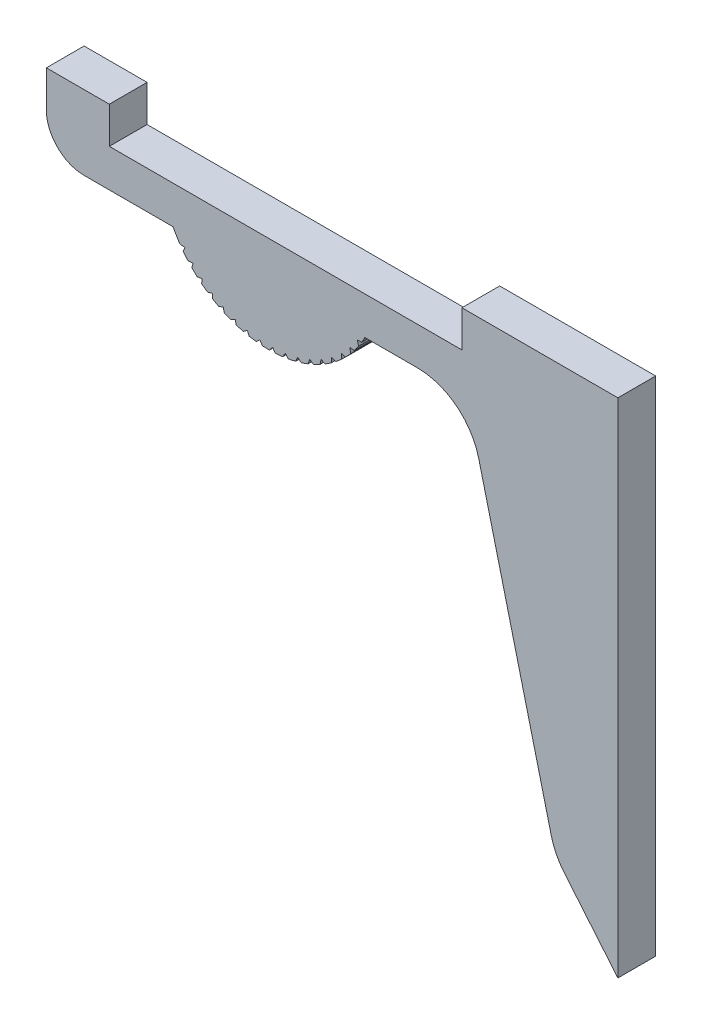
ISO-10303-21;
HEADER;
FILE_DESCRIPTION(('STEP AP214'),'2;1');
FILE_NAME('part.step','',(''),(''),'','','');
FILE_SCHEMA(('AUTOMOTIVE_DESIGN { 1 0 10303 214 1 1 1 1 }'));
ENDSEC;
DATA;
#1=APPLICATION_CONTEXT('core data for automotive mechanical design processes');
#2=APPLICATION_PROTOCOL_DEFINITION('international standard','automotive_design',2000,#1);
#3=PRODUCT_CONTEXT('',#1,'mechanical');
#4=PRODUCT('Part','Part','',(#3));
#5=PRODUCT_RELATED_PRODUCT_CATEGORY('part','',(#4));
#6=PRODUCT_DEFINITION_FORMATION('','',#4);
#7=PRODUCT_DEFINITION_CONTEXT('part definition',#1,'design');
#8=PRODUCT_DEFINITION('design','',#6,#7);
#9=PRODUCT_DEFINITION_SHAPE('','',#8);
#10=(LENGTH_UNIT() NAMED_UNIT(*) SI_UNIT(.MILLI.,.METRE.));
#11=(NAMED_UNIT(*) PLANE_ANGLE_UNIT() SI_UNIT($,.RADIAN.));
#12=(NAMED_UNIT(*) SI_UNIT($,.STERADIAN.) SOLID_ANGLE_UNIT());
#13=UNCERTAINTY_MEASURE_WITH_UNIT(LENGTH_MEASURE(1.E-05),#10,'distance_accuracy_value','');
#14=(GEOMETRIC_REPRESENTATION_CONTEXT(3) GLOBAL_UNCERTAINTY_ASSIGNED_CONTEXT((#13)) GLOBAL_UNIT_ASSIGNED_CONTEXT((#10,
#11,#12)) REPRESENTATION_CONTEXT('',''));
#15=CARTESIAN_POINT('',(0.,0.,0.));
#16=DIRECTION('',(0.,0.,1.));
#17=DIRECTION('',(1.,0.,0.));
#18=AXIS2_PLACEMENT_3D('',#15,#16,#17);
#19=CARTESIAN_POINT('',(-45.3846510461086,-6.,-3.));
#20=DIRECTION('',(0.,-1.,0.));
#21=DIRECTION('',(1.,0.,0.));
#22=AXIS2_PLACEMENT_3D('',#19,#20,#21);
#23=PLANE('',#22);
#24=DIRECTION('',(1.,0.,0.));
#25=VECTOR('',#24,1.);
#26=CARTESIAN_POINT('',(-45.3846510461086,-6.,-3.));
#27=LINE('',#26,#25);
#28=CARTESIAN_POINT('',(-42.3846510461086,-6.,-3.));
#29=VERTEX_POINT('',#28);
#30=CARTESIAN_POINT('',(-35.3219522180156,-6.,-3.));
#31=VERTEX_POINT('',#30);
#32=EDGE_CURVE('E522',#29,#31,#27,.T.);
#33=ORIENTED_EDGE('',*,*,#32,.T.);
#34=DIRECTION('',(0.,0.,-1.));
#35=VECTOR('',#34,1.);
#36=CARTESIAN_POINT('',(-35.3219522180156,-6.,0.));
#37=LINE('',#36,#35);
#38=CARTESIAN_POINT('',(-35.3219522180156,-6.,0.));
#39=VERTEX_POINT('',#38);
#40=EDGE_CURVE('E623',#39,#31,#37,.T.);
#41=ORIENTED_EDGE('',*,*,#40,.F.);
#42=DIRECTION('',(1.,0.,0.));
#43=VECTOR('',#42,1.);
#44=CARTESIAN_POINT('',(-45.3846510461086,-6.,0.));
#45=LINE('',#44,#43);
#46=CARTESIAN_POINT('',(-42.3846510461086,-6.,0.));
#47=VERTEX_POINT('',#46);
#48=EDGE_CURVE('E464',#47,#39,#45,.T.);
#49=ORIENTED_EDGE('',*,*,#48,.F.);
#50=DIRECTION('',(0.,0.,1.));
#51=VECTOR('',#50,1.);
#52=CARTESIAN_POINT('',(-42.3846510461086,-6.,-3.));
#53=LINE('',#52,#51);
#54=EDGE_CURVE('E549',#47,#29,#53,.F.);
#55=ORIENTED_EDGE('',*,*,#54,.T.);
#56=EDGE_LOOP('',(#33,#41,#49,#55));
#57=FACE_BOUND('',#56,.T.);
#58=ADVANCED_FACE('F33',(#57),#23,.T.);
#59=CARTESIAN_POINT('',(-20.0903169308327,-6.,0.));
#60=VERTEX_POINT('',#59);
#61=CARTESIAN_POINT('',(-15.9038820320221,-6.,0.));
#62=VERTEX_POINT('',#61);
#63=EDGE_CURVE('E536',#60,#62,#45,.T.);
#64=ORIENTED_EDGE('',*,*,#63,.F.);
#65=DIRECTION('',(0.,0.,-1.));
#66=VECTOR('',#65,1.);
#67=CARTESIAN_POINT('',(-20.0903169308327,-6.,0.));
#68=LINE('',#67,#66);
#69=CARTESIAN_POINT('',(-20.0903169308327,-6.,-3.));
#70=VERTEX_POINT('',#69);
#71=EDGE_CURVE('E48',#60,#70,#68,.T.);
#72=ORIENTED_EDGE('',*,*,#71,.T.);
#73=CARTESIAN_POINT('',(-15.9038820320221,-6.,-3.));
#74=VERTEX_POINT('',#73);
#75=EDGE_CURVE('E55',#70,#74,#27,.T.);
#76=ORIENTED_EDGE('',*,*,#75,.T.);
#77=DIRECTION('',(0.,0.,1.));
#78=VECTOR('',#77,1.);
#79=CARTESIAN_POINT('',(-15.9038820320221,-6.,0.));
#80=LINE('',#79,#78);
#81=EDGE_CURVE('E564',#74,#62,#80,.T.);
#82=ORIENTED_EDGE('',*,*,#81,.T.);
#83=EDGE_LOOP('',(#64,#72,#76,#82));
#84=FACE_BOUND('',#83,.T.);
#85=ADVANCED_FACE('F890',(#84),#23,.T.);
#86=CARTESIAN_POINT('',(-5.,-34.,-3.));
#87=DIRECTION('',(-0.768221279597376,-0.64018439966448,0.));
#88=DIRECTION('',(0.64018439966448,-0.768221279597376,0.));
#89=AXIS2_PLACEMENT_3D('',#86,#87,#88);
#90=PLANE('',#89);
#91=DIRECTION('',(0.64018439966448,-0.768221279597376,0.));
#92=VECTOR('',#91,1.);
#93=CARTESIAN_POINT('',(-5.,-34.,0.));
#94=LINE('',#93,#92);
#95=CARTESIAN_POINT('',(-4.26779266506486,-34.8786488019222,0.));
#96=VERTEX_POINT('',#95);
#97=CARTESIAN_POINT('',(0.,-40.,0.));
#98=VERTEX_POINT('',#97);
#99=EDGE_CURVE('E510',#96,#98,#94,.T.);
#100=ORIENTED_EDGE('',*,*,#99,.F.);
#101=DIRECTION('',(0.,0.,1.));
#102=VECTOR('',#101,1.);
#103=CARTESIAN_POINT('',(-4.26779266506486,-34.8786488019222,-3.));
#104=LINE('',#103,#102);
#105=CARTESIAN_POINT('',(-4.26779266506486,-34.8786488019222,-3.));
#106=VERTEX_POINT('',#105);
#107=EDGE_CURVE('E560',#96,#106,#104,.F.);
#108=ORIENTED_EDGE('',*,*,#107,.T.);
#109=DIRECTION('',(0.64018439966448,-0.768221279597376,0.));
#110=VECTOR('',#109,1.);
#111=CARTESIAN_POINT('',(-5.,-34.,-3.));
#112=LINE('',#111,#110);
#113=CARTESIAN_POINT('',(0.,-40.,-3.));
#114=VERTEX_POINT('',#113);
#115=EDGE_CURVE('E513',#106,#114,#112,.T.);
#116=ORIENTED_EDGE('',*,*,#115,.T.);
#117=DIRECTION('',(0.,0.,1.));
#118=VECTOR('',#117,1.);
#119=CARTESIAN_POINT('',(0.,-40.,-3.));
#120=LINE('',#119,#118);
#121=EDGE_CURVE('E528',#114,#98,#120,.T.);
#122=ORIENTED_EDGE('',*,*,#121,.T.);
#123=EDGE_LOOP('',(#100,#108,#116,#122));
#124=FACE_BOUND('',#123,.T.);
#125=ADVANCED_FACE('F586',(#124),#90,.T.);
#126=CARTESIAN_POINT('',(-12.,-6.,-3.));
#127=DIRECTION('',(-0.970142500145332,-0.242535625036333,0.));
#128=DIRECTION('',(0.242535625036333,-0.970142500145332,0.));
#129=AXIS2_PLACEMENT_3D('',#126,#127,#128);
#130=PLANE('',#129);
#131=DIRECTION('',(0.242535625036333,-0.970142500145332,0.));
#132=VECTOR('',#131,1.);
#133=CARTESIAN_POINT('',(-12.,-6.,-3.));
#134=LINE('',#133,#132);
#135=CARTESIAN_POINT('',(-11.0531695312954,-9.78732187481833,-3.));
#136=VERTEX_POINT('',#135);
#137=CARTESIAN_POINT('',(-5.27739876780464,-32.8904049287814,-3.));
#138=VERTEX_POINT('',#137);
#139=EDGE_CURVE('E525',#136,#138,#134,.T.);
#140=ORIENTED_EDGE('',*,*,#139,.T.);
#141=DIRECTION('',(0.,0.,1.));
#142=VECTOR('',#141,1.);
#143=CARTESIAN_POINT('',(-5.27739876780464,-32.8904049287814,-3.));
#144=LINE('',#143,#142);
#145=CARTESIAN_POINT('',(-5.27739876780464,-32.8904049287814,0.));
#146=VERTEX_POINT('',#145);
#147=EDGE_CURVE('E555',#138,#146,#144,.T.);
#148=ORIENTED_EDGE('',*,*,#147,.T.);
#149=DIRECTION('',(0.242535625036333,-0.970142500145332,0.));
#150=VECTOR('',#149,1.);
#151=CARTESIAN_POINT('',(-12.,-6.,0.));
#152=LINE('',#151,#150);
#153=CARTESIAN_POINT('',(-11.0531695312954,-9.78732187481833,0.));
#154=VERTEX_POINT('',#153);
#155=EDGE_CURVE('E516',#154,#146,#152,.T.);
#156=ORIENTED_EDGE('',*,*,#155,.F.);
#157=DIRECTION('',(0.,0.,1.));
#158=VECTOR('',#157,1.);
#159=CARTESIAN_POINT('',(-11.0531695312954,-9.78732187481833,-3.));
#160=LINE('',#159,#158);
#161=EDGE_CURVE('E553',#154,#136,#160,.F.);
#162=ORIENTED_EDGE('',*,*,#161,.T.);
#163=EDGE_LOOP('',(#140,#148,#156,#162));
#164=FACE_BOUND('',#163,.T.);
#165=ADVANCED_FACE('F572',(#164),#130,.T.);
#166=CARTESIAN_POINT('',(-45.3846510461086,0.,-3.));
#167=DIRECTION('',(-1.,0.,0.));
#168=DIRECTION('',(0.,0.,1.));
#169=AXIS2_PLACEMENT_3D('',#166,#167,#168);
#170=PLANE('',#169);
#171=DIRECTION('',(0.,-1.,0.));
#172=VECTOR('',#171,1.);
#173=CARTESIAN_POINT('',(-45.3846510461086,0.,-3.));
#174=LINE('',#173,#172);
#175=CARTESIAN_POINT('',(-45.3846510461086,-0.0999999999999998,-3.));
#176=VERTEX_POINT('',#175);
#177=CARTESIAN_POINT('',(-45.3846510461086,-3.,-3.));
#178=VERTEX_POINT('',#177);
#179=EDGE_CURVE('E519',#176,#178,#174,.T.);
#180=ORIENTED_EDGE('',*,*,#179,.T.);
#181=DIRECTION('',(0.,0.,1.));
#182=VECTOR('',#181,1.);
#183=CARTESIAN_POINT('',(-45.3846510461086,-3.,-3.));
#184=LINE('',#183,#182);
#185=CARTESIAN_POINT('',(-45.3846510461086,-3.,0.));
#186=VERTEX_POINT('',#185);
#187=EDGE_CURVE('E544',#178,#186,#184,.T.);
#188=ORIENTED_EDGE('',*,*,#187,.T.);
#189=DIRECTION('',(0.,-1.,0.));
#190=VECTOR('',#189,1.);
#191=CARTESIAN_POINT('',(-45.3846510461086,0.,0.));
#192=LINE('',#191,#190);
#193=CARTESIAN_POINT('',(-45.3846510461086,-0.0999999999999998,0.));
#194=VERTEX_POINT('',#193);
#195=EDGE_CURVE('E533',#194,#186,#192,.T.);
#196=ORIENTED_EDGE('',*,*,#195,.F.);
#197=DIRECTION('',(0.,0.,1.));
#198=VECTOR('',#197,1.);
#199=CARTESIAN_POINT('',(-45.3846510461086,-0.0999999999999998,-10.));
#200=LINE('',#199,#198);
#201=EDGE_CURVE('E480',#176,#194,#200,.T.);
#202=ORIENTED_EDGE('',*,*,#201,.F.);
#203=EDGE_LOOP('',(#180,#188,#196,#202));
#204=FACE_BOUND('',#203,.T.);
#205=ADVANCED_FACE('F618',(#204),#170,.T.);
#206=CARTESIAN_POINT('',(0.,-40.,-3.));
#207=DIRECTION('',(1.,0.,0.));
#208=DIRECTION('',(0.,0.,-1.));
#209=AXIS2_PLACEMENT_3D('',#206,#207,#208);
#210=PLANE('',#209);
#211=DIRECTION('',(0.,0.,1.));
#212=VECTOR('',#211,1.);
#213=CARTESIAN_POINT('',(0.,-0.1,-10.));
#214=LINE('',#213,#212);
#215=CARTESIAN_POINT('',(0.,-0.1,-3.));
#216=VERTEX_POINT('',#215);
#217=CARTESIAN_POINT('',(0.,-0.1,0.));
#218=VERTEX_POINT('',#217);
#219=EDGE_CURVE('E481',#216,#218,#214,.T.);
#220=ORIENTED_EDGE('',*,*,#219,.T.);
#221=DIRECTION('',(0.,1.,0.));
#222=VECTOR('',#221,1.);
#223=CARTESIAN_POINT('',(0.,-40.,0.));
#224=LINE('',#223,#222);
#225=EDGE_CURVE('E530',#98,#218,#224,.T.);
#226=ORIENTED_EDGE('',*,*,#225,.F.);
#227=ORIENTED_EDGE('',*,*,#121,.F.);
#228=DIRECTION('',(0.,1.,0.));
#229=VECTOR('',#228,1.);
#230=CARTESIAN_POINT('',(0.,-40.,-3.));
#231=LINE('',#230,#229);
#232=EDGE_CURVE('E515',#114,#216,#231,.T.);
#233=ORIENTED_EDGE('',*,*,#232,.T.);
#234=EDGE_LOOP('',(#220,#226,#227,#233));
#235=FACE_BOUND('',#234,.T.);
#236=ADVANCED_FACE('F591',(#235),#210,.T.);
#237=CARTESIAN_POINT('',(0.,0.,-3.));
#238=DIRECTION('',(0.,0.,-1.));
#239=DIRECTION('',(-1.,0.,0.));
#240=AXIS2_PLACEMENT_3D('',#237,#238,#239);
#241=PLANE('',#240);
#242=ORIENTED_EDGE('',*,*,#115,.F.);
#243=CARTESIAN_POINT('',(-0.426686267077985,-31.6777268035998,-3.));
#244=DIRECTION('',(0.,0.,-1.));
#245=DIRECTION('',(-1.,0.,0.));
#246=AXIS2_PLACEMENT_3D('',#243,#244,#245);
#247=CIRCLE('',#246,5.);
#248=EDGE_CURVE('E562',#106,#138,#247,.T.);
#249=ORIENTED_EDGE('',*,*,#248,.T.);
#250=ORIENTED_EDGE('',*,*,#139,.F.);
#251=CARTESIAN_POINT('',(-15.9038820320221,-11.,-3.));
#252=DIRECTION('',(0.,0.,-1.));
#253=DIRECTION('',(-1.,0.,0.));
#254=AXIS2_PLACEMENT_3D('',#251,#252,#253);
#255=CIRCLE('',#254,5.);
#256=EDGE_CURVE('E11',#136,#74,#255,.F.);
#257=ORIENTED_EDGE('',*,*,#256,.T.);
#258=ORIENTED_EDGE('',*,*,#75,.F.);
#259=CARTESIAN_POINT('',(-27.7061345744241,-2.08850310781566,-3.));
#260=DIRECTION('',(0.,0.,1.));
#261=DIRECTION('',(1.,0.,0.));
#262=AXIS2_PLACEMENT_3D('',#259,#260,#261);
#263=CIRCLE('',#262,8.56157031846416);
#264=CARTESIAN_POINT('',(-20.3427335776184,-6.45666199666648,-3.));
#265=VERTEX_POINT('',#264);
#266=EDGE_CURVE('E467',#265,#70,#263,.T.);
#267=ORIENTED_EDGE('',*,*,#266,.F.);
#268=DIRECTION('',(1.,0.,0.));
#269=VECTOR('',#268,1.);
#270=CARTESIAN_POINT('',(-20.7008295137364,-6.45666199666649,-3.));
#271=LINE('',#270,#269);
#272=CARTESIAN_POINT('',(-20.7008295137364,-6.45666199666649,-3.));
#273=VERTEX_POINT('',#272);
#274=EDGE_CURVE('E885',#273,#265,#271,.T.);
#275=ORIENTED_EDGE('',*,*,#274,.F.);
#276=DIRECTION('',(-0.294653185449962,0.955604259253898,0.));
#277=VECTOR('',#276,1.);
#278=CARTESIAN_POINT('',(-20.5830862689,-6.83852091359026,-3.));
#279=LINE('',#278,#277);
#280=CARTESIAN_POINT('',(-20.5830862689,-6.83852091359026,-3.));
#281=VERTEX_POINT('',#280);
#282=EDGE_CURVE('E884',#281,#273,#279,.T.);
#283=ORIENTED_EDGE('',*,*,#282,.F.);
#284=CARTESIAN_POINT('',(-27.7061345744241,-2.08850310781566,-3.));
#285=DIRECTION('',(0.,0.,1.));
#286=DIRECTION('',(1.,0.,0.));
#287=AXIS2_PLACEMENT_3D('',#284,#285,#286);
#288=CIRCLE('',#287,8.56157031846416);
#289=CARTESIAN_POINT('',(-20.9299639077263,-7.3214752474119,-3.));
#290=VERTEX_POINT('',#289);
#291=EDGE_CURVE('E882',#290,#281,#288,.T.);
#292=ORIENTED_EDGE('',*,*,#291,.F.);
#293=DIRECTION('',(0.992546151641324,-0.121869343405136,0.));
#294=VECTOR('',#293,1.);
#295=CARTESIAN_POINT('',(-21.2853906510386,-7.27783433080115,-3.));
#296=LINE('',#295,#294);
#297=CARTESIAN_POINT('',(-21.2853906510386,-7.27783433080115,-3.));
#298=VERTEX_POINT('',#297);
#299=EDGE_CURVE('E880',#298,#290,#296,.T.);
#300=ORIENTED_EDGE('',*,*,#299,.F.);
#301=DIRECTION('',(-0.175998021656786,0.984390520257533,0.));
#302=VECTOR('',#301,1.);
#303=CARTESIAN_POINT('',(-21.2150619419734,-7.67119622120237,-3.));
#304=LINE('',#303,#302);
#305=CARTESIAN_POINT('',(-21.2150619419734,-7.67119622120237,-3.));
#306=VERTEX_POINT('',#305);
#307=EDGE_CURVE('E878',#306,#298,#304,.T.);
#308=ORIENTED_EDGE('',*,*,#307,.F.);
#309=CARTESIAN_POINT('',(-27.7061345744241,-2.08850310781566,-3.));
#310=DIRECTION('',(0.,0.,1.));
#311=DIRECTION('',(1.,0.,0.));
#312=AXIS2_PLACEMENT_3D('',#309,#310,#311);
#313=CIRCLE('',#312,8.56157031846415);
#314=CARTESIAN_POINT('',(-21.6182113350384,-8.10827693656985,-3.));
#315=VERTEX_POINT('',#314);
#316=EDGE_CURVE('E876',#315,#306,#313,.T.);
#317=ORIENTED_EDGE('',*,*,#316,.F.);
#318=DIRECTION('',(0.970295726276,-0.241921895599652,0.));
#319=VECTOR('',#318,1.);
#320=CARTESIAN_POINT('',(-21.9656702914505,-8.02164568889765,-3.));
#321=LINE('',#320,#319);
#322=CARTESIAN_POINT('',(-21.9656702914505,-8.02164568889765,-3.));
#323=VERTEX_POINT('',#322);
#324=EDGE_CURVE('E874',#323,#315,#321,.T.);
#325=ORIENTED_EDGE('',*,*,#324,.F.);
#326=DIRECTION('',(-0.0547191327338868,0.998501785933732,0.));
#327=VECTOR('',#326,1.);
#328=CARTESIAN_POINT('',(-21.9438045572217,-8.42064643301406,-3.));
#329=LINE('',#328,#327);
#330=CARTESIAN_POINT('',(-21.9438045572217,-8.42064643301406,-3.));
#331=VERTEX_POINT('',#330);
#332=EDGE_CURVE('E872',#331,#323,#329,.T.);
#333=ORIENTED_EDGE('',*,*,#332,.F.);
#334=CARTESIAN_POINT('',(-27.7061345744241,-2.08850310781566,-3.));
#335=DIRECTION('',(0.,0.,1.));
#336=DIRECTION('',(1.,0.,0.));
#337=AXIS2_PLACEMENT_3D('',#334,#335,#336);
#338=CIRCLE('',#337,8.56157031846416);
#339=CARTESIAN_POINT('',(-22.3972156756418,-8.80533766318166,-3.));
#340=VERTEX_POINT('',#339);
#341=EDGE_CURVE('E870',#340,#331,#338,.T.);
#342=ORIENTED_EDGE('',*,*,#341,.F.);
#343=DIRECTION('',(0.933580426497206,-0.35836794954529,0.));
#344=VECTOR('',#343,1.);
#345=CARTESIAN_POINT('',(-22.7315270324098,-8.67700755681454,-3.));
#346=LINE('',#345,#344);
#347=CARTESIAN_POINT('',(-22.7315270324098,-8.67700755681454,-3.));
#348=VERTEX_POINT('',#347);
#349=EDGE_CURVE('E868',#348,#340,#346,.T.);
#350=ORIENTED_EDGE('',*,*,#349,.F.);
#351=DIRECTION('',(0.0673754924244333,0.997727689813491,0.));
#352=VECTOR('',#351,1.);
#353=CARTESIAN_POINT('',(-22.7584502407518,-9.07569897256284,-3.));
#354=LINE('',#353,#352);
#355=CARTESIAN_POINT('',(-22.7584502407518,-9.07569897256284,-3.));
#356=VERTEX_POINT('',#355);
#357=EDGE_CURVE('E866',#356,#348,#354,.T.);
#358=ORIENTED_EDGE('',*,*,#357,.F.);
#359=CARTESIAN_POINT('',(-27.7061345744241,-2.08850310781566,-3.));
#360=DIRECTION('',(0.,0.,1.));
#361=DIRECTION('',(1.,0.,0.));
#362=AXIS2_PLACEMENT_3D('',#359,#360,#361);
#363=CIRCLE('',#362,8.56157031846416);
#364=CARTESIAN_POINT('',(-23.2553637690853,-9.40226585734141,-3.));
#365=VERTEX_POINT('',#364);
#366=EDGE_CURVE('E864',#365,#356,#363,.T.);
#367=ORIENTED_EDGE('',*,*,#366,.F.);
#368=DIRECTION('',(0.882947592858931,-0.469471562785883,0.));
#369=VECTOR('',#368,1.);
#370=CARTESIAN_POINT('',(-23.5715437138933,-9.23414999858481,-3.));
#371=LINE('',#370,#369);
#372=CARTESIAN_POINT('',(-23.5715437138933,-9.23414999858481,-3.));
#373=VERTEX_POINT('',#372);
#374=EDGE_CURVE('E862',#373,#365,#371,.T.);
#375=ORIENTED_EDGE('',*,*,#374,.F.);
#376=DIRECTION('',(0.188465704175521,0.982079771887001,0.));
#377=VECTOR('',#376,1.);
#378=CARTESIAN_POINT('',(-23.6468545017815,-9.62658851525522,-3.));
#379=LINE('',#378,#377);
#380=CARTESIAN_POINT('',(-23.6468545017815,-9.62658851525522,-3.));
#381=VERTEX_POINT('',#380);
#382=EDGE_CURVE('E860',#381,#373,#379,.T.);
#383=ORIENTED_EDGE('',*,*,#382,.F.);
#384=CARTESIAN_POINT('',(-27.7061345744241,-2.08850310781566,-3.));
#385=DIRECTION('',(0.,0.,1.));
#386=DIRECTION('',(1.,0.,0.));
#387=AXIS2_PLACEMENT_3D('',#384,#385,#386);
#388=CIRCLE('',#387,8.56157031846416);
#389=CARTESIAN_POINT('',(-24.1798626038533,-9.89016269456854,-3.));
#390=VERTEX_POINT('',#389);
#391=EDGE_CURVE('E858',#390,#381,#388,.T.);
#392=ORIENTED_EDGE('',*,*,#391,.F.);
#393=DIRECTION('',(0.819152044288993,-0.573576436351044,0.));
#394=VECTOR('',#393,1.);
#395=CARTESIAN_POINT('',(-24.4731976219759,-9.68476730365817,-3.));
#396=LINE('',#395,#394);
#397=CARTESIAN_POINT('',(-24.4731976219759,-9.68476730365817,-3.));
#398=VERTEX_POINT('',#397);
#399=EDGE_CURVE('E856',#398,#390,#396,.T.);
#400=ORIENTED_EDGE('',*,*,#399,.F.);
#401=DIRECTION('',(0.306746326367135,0.95179130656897,0.));
#402=VECTOR('',#401,1.);
#403=CARTESIAN_POINT('',(-24.595773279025,-10.0651025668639,-3.));
#404=LINE('',#403,#402);
#405=CARTESIAN_POINT('',(-24.595773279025,-10.0651025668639,-3.));
#406=VERTEX_POINT('',#405);
#407=EDGE_CURVE('E854',#406,#398,#404,.T.);
#408=ORIENTED_EDGE('',*,*,#407,.F.);
#409=CARTESIAN_POINT('',(-27.7061345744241,-2.08850310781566,-3.));
#410=DIRECTION('',(0.,0.,1.));
#411=DIRECTION('',(1.,0.,0.));
#412=AXIS2_PLACEMENT_3D('',#409,#410,#411);
#413=CIRCLE('',#412,8.56157031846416);
#414=CARTESIAN_POINT('',(-25.1569300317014,-10.2617547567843,-3.));
#415=VERTEX_POINT('',#414);
#416=EDGE_CURVE('E852',#415,#406,#413,.T.);
#417=ORIENTED_EDGE('',*,*,#416,.F.);
#418=DIRECTION('',(0.7431448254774,-0.669130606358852,0.));
#419=VECTOR('',#418,1.);
#420=CARTESIAN_POINT('',(-25.423047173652,-10.022141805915,-3.));
#421=LINE('',#420,#419);
#422=CARTESIAN_POINT('',(-25.423047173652,-10.022141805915,-3.));
#423=VERTEX_POINT('',#422);
#424=EDGE_CURVE('E850',#423,#415,#421,.T.);
#425=ORIENTED_EDGE('',*,*,#424,.F.);
#426=DIRECTION('',(0.420454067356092,0.907313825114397,0.));
#427=VECTOR('',#426,1.);
#428=CARTESIAN_POINT('',(-25.5910603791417,-10.3847038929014,-3.));
#429=LINE('',#428,#427);
#430=CARTESIAN_POINT('',(-25.5910603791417,-10.3847038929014,-3.));
#431=VERTEX_POINT('',#430);
#432=EDGE_CURVE('E848',#431,#423,#429,.T.);
#433=ORIENTED_EDGE('',*,*,#432,.F.);
#434=CARTESIAN_POINT('',(-27.7061345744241,-2.08850310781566,-3.));
#435=DIRECTION('',(0.,0.,1.));
#436=DIRECTION('',(1.,0.,0.));
#437=AXIS2_PLACEMENT_3D('',#434,#435,#436);
#438=CIRCLE('',#437,8.56157031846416);
#439=CARTESIAN_POINT('',(-26.172000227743,-10.5115024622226,-3.));
#440=VERTEX_POINT('',#439);
#441=EDGE_CURVE('E846',#440,#431,#438,.T.);
#442=ORIENTED_EDGE('',*,*,#441,.F.);
#443=DIRECTION('',(0.65605902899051,-0.75470958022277,0.));
#444=VECTOR('',#443,1.);
#445=CARTESIAN_POINT('',(-26.406932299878,-10.2412440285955,-3.));
#446=LINE('',#445,#444);
#447=CARTESIAN_POINT('',(-26.406932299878,-10.2412440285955,-3.));
#448=VERTEX_POINT('',#447);
#449=EDGE_CURVE('E844',#448,#440,#446,.T.);
#450=ORIENTED_EDGE('',*,*,#449,.F.);
#451=DIRECTION('',(0.527893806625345,0.849310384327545,0.));
#452=VECTOR('',#451,1.);
#453=CARTESIAN_POINT('',(-26.6178783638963,-10.5806279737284,-3.));
#454=LINE('',#453,#452);
#455=CARTESIAN_POINT('',(-26.6178783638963,-10.5806279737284,-3.));
#456=VERTEX_POINT('',#455);
#457=EDGE_CURVE('E842',#456,#448,#454,.T.);
#458=ORIENTED_EDGE('',*,*,#457,.F.);
#459=CARTESIAN_POINT('',(-27.7061345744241,-2.08850310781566,-3.));
#460=DIRECTION('',(0.,0.,1.));
#461=DIRECTION('',(1.,0.,0.));
#462=AXIS2_PLACEMENT_3D('',#459,#460,#461);
#463=CIRCLE('',#462,8.56157031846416);
#464=CARTESIAN_POINT('',(-27.2099408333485,-10.6356826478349,-3.));
#465=VERTEX_POINT('',#464);
#466=EDGE_CURVE('E840',#465,#456,#463,.T.);
#467=ORIENTED_EDGE('',*,*,#466,.F.);
#468=DIRECTION('',(0.559192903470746,-0.829037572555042,0.));
#469=VECTOR('',#468,1.);
#470=CARTESIAN_POINT('',(-27.4101855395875,-10.3388076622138,-3.));
#471=LINE('',#470,#469);
#472=CARTESIAN_POINT('',(-27.4101855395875,-10.3388076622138,-3.));
#473=VERTEX_POINT('',#472);
#474=EDGE_CURVE('E838',#473,#465,#471,.T.);
#475=ORIENTED_EDGE('',*,*,#474,.F.);
#476=DIRECTION('',(0.627463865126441,0.778645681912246,0.));
#477=VECTOR('',#476,1.);
#478=CARTESIAN_POINT('',(-27.6609197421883,-10.6499540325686,-3.));
#479=LINE('',#478,#477);
#480=CARTESIAN_POINT('',(-27.6609197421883,-10.6499540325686,-3.));
#481=VERTEX_POINT('',#480);
#482=EDGE_CURVE('E836',#481,#473,#479,.T.);
#483=ORIENTED_EDGE('',*,*,#482,.F.);
#484=CARTESIAN_POINT('',(-27.7061345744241,-2.08850310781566,-3.));
#485=DIRECTION('',(0.,0.,1.));
#486=DIRECTION('',(1.,0.,0.));
#487=AXIS2_PLACEMENT_3D('',#484,#485,#486);
#488=CIRCLE('',#487,8.56157031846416);
#489=CARTESIAN_POINT('',(-28.2552785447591,-10.6324440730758,-3.));
#490=VERTEX_POINT('',#489);
#491=EDGE_CURVE('E834',#490,#481,#488,.T.);
#492=ORIENTED_EDGE('',*,*,#491,.F.);
#493=DIRECTION('',(0.453990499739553,-0.891006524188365,0.));
#494=VECTOR('',#493,1.);
#495=CARTESIAN_POINT('',(-28.417850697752,-10.3133782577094,-3.));
#496=LINE('',#495,#494);
#497=CARTESIAN_POINT('',(-28.417850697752,-10.3133782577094,-3.));
#498=VERTEX_POINT('',#497);
#499=EDGE_CURVE('E832',#498,#490,#496,.T.);
#500=ORIENTED_EDGE('',*,*,#499,.F.);
#501=DIRECTION('',(0.717679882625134,0.696373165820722,0.));
#502=VECTOR('',#501,1.);
#503=CARTESIAN_POINT('',(-28.7046351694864,-10.5916485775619,-3.));
#504=LINE('',#503,#502);
#505=CARTESIAN_POINT('',(-28.7046351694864,-10.5916485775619,-3.));
#506=VERTEX_POINT('',#505);
#507=EDGE_CURVE('E830',#506,#498,#504,.T.);
#508=ORIENTED_EDGE('',*,*,#507,.F.);
#509=CARTESIAN_POINT('',(-27.7061345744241,-2.08850310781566,-3.));
#510=DIRECTION('',(0.,0.,1.));
#511=DIRECTION('',(1.,0.,0.));
#512=AXIS2_PLACEMENT_3D('',#509,#510,#511);
#513=CIRCLE('',#512,8.56157031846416);
#514=CARTESIAN_POINT('',(-29.2924297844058,-10.5018350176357,-3.));
#515=VERTEX_POINT('',#514);
#516=EDGE_CURVE('E828',#515,#506,#513,.T.);
#517=ORIENTED_EDGE('',*,*,#516,.F.);
#518=DIRECTION('',(0.342020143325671,-0.939692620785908,0.));
#519=VECTOR('',#518,1.);
#520=CARTESIAN_POINT('',(-29.4149058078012,-10.1653349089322,-3.));
#521=LINE('',#520,#519);
#522=CARTESIAN_POINT('',(-29.4149058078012,-10.1653349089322,-3.));
#523=VERTEX_POINT('',#522);
#524=EDGE_CURVE('E826',#523,#515,#521,.T.);
#525=ORIENTED_EDGE('',*,*,#524,.F.);
#526=DIRECTION('',(0.797196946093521,0.603719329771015,0.));
#527=VECTOR('',#526,1.);
#528=CARTESIAN_POINT('',(-29.7334652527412,-10.4065808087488,-3.));
#529=LINE('',#528,#527);
#530=CARTESIAN_POINT('',(-29.7334652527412,-10.4065808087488,-3.));
#531=VERTEX_POINT('',#530);
#532=EDGE_CURVE('E824',#531,#523,#529,.T.);
#533=ORIENTED_EDGE('',*,*,#532,.F.);
#534=CARTESIAN_POINT('',(-27.7061345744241,-2.08850310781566,-3.));
#535=DIRECTION('',(0.,0.,1.));
#536=DIRECTION('',(1.,0.,0.));
#537=AXIS2_PLACEMENT_3D('',#534,#535,#536);
#538=CIRCLE('',#537,8.56157031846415);
#539=CARTESIAN_POINT('',(-30.3059330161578,-10.2458025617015,-3.));
#540=VERTEX_POINT('',#539);
#541=EDGE_CURVE('E822',#540,#531,#538,.T.);
#542=ORIENTED_EDGE('',*,*,#541,.F.);
#543=DIRECTION('',(0.224951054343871,-0.974370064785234,0.));
#544=VECTOR('',#543,1.);
#545=CARTESIAN_POINT('',(-30.3864870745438,-9.89688460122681,-3.));
#546=LINE('',#545,#544);
#547=CARTESIAN_POINT('',(-30.3864870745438,-9.89688460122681,-3.));
#548=VERTEX_POINT('',#547);
#549=EDGE_CURVE('E820',#548,#540,#546,.T.);
#550=ORIENTED_EDGE('',*,*,#549,.F.);
#551=DIRECTION('',(0.864829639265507,0.502065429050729,0.));
#552=VECTOR('',#551,1.);
#553=CARTESIAN_POINT('',(-30.7320725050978,-10.0975096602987,-3.));
#554=LINE('',#553,#552);
#555=CARTESIAN_POINT('',(-30.7320725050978,-10.0975096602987,-3.));
#556=VERTEX_POINT('',#555);
#557=EDGE_CURVE('E818',#556,#548,#554,.T.);
#558=ORIENTED_EDGE('',*,*,#557,.F.);
#559=CARTESIAN_POINT('',(-27.7061345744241,-2.08850310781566,-3.));
#560=DIRECTION('',(0.,0.,1.));
#561=DIRECTION('',(1.,0.,0.));
#562=AXIS2_PLACEMENT_3D('',#559,#560,#561);
#563=CIRCLE('',#562,8.56157031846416);
#564=CARTESIAN_POINT('',(-31.2806792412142,-9.86816355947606,-3.));
#565=VERTEX_POINT('',#564);
#566=EDGE_CURVE('E816',#565,#556,#563,.T.);
#567=ORIENTED_EDGE('',*,*,#566,.F.);
#568=DIRECTION('',(0.104528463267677,-0.994521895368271,0.));
#569=VECTOR('',#568,1.);
#570=CARTESIAN_POINT('',(-31.318110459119,-9.51202931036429,-3.));
#571=LINE('',#570,#569);
#572=CARTESIAN_POINT('',(-31.318110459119,-9.51202931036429,-3.));
#573=VERTEX_POINT('',#572);
#574=EDGE_CURVE('E814',#573,#565,#571,.T.);
#575=ORIENTED_EDGE('',*,*,#574,.F.);
#576=DIRECTION('',(0.919569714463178,0.39292688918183,0.));
#577=VECTOR('',#576,1.);
#578=CARTESIAN_POINT('',(-31.6855699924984,-9.66904267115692,-3.));
#579=LINE('',#578,#577);
#580=CARTESIAN_POINT('',(-31.6855699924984,-9.66904267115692,-3.));
#581=VERTEX_POINT('',#580);
#582=EDGE_CURVE('E812',#581,#573,#579,.T.);
#583=ORIENTED_EDGE('',*,*,#582,.F.);
#584=CARTESIAN_POINT('',(-27.7061345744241,-2.08850310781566,-3.));
#585=DIRECTION('',(0.,0.,1.));
#586=DIRECTION('',(1.,0.,0.));
#587=AXIS2_PLACEMENT_3D('',#584,#585,#586);
#588=CIRCLE('',#587,8.56157031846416);
#589=CARTESIAN_POINT('',(-32.2021372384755,-9.3745477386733,-3.));
#590=VERTEX_POINT('',#589);
#591=EDGE_CURVE('E810',#590,#581,#588,.T.);
#592=ORIENTED_EDGE('',*,*,#591,.F.);
#593=DIRECTION('',(-0.0174524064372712,-0.999847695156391,0.));
#594=VECTOR('',#593,1.);
#595=CARTESIAN_POINT('',(-32.1958876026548,-9.01650634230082,-3.));
#596=LINE('',#595,#594);
#597=CARTESIAN_POINT('',(-32.1958876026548,-9.01650634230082,-3.));
#598=VERTEX_POINT('',#597);
#599=EDGE_CURVE('E808',#598,#590,#596,.T.);
#600=ORIENTED_EDGE('',*,*,#599,.F.);
#601=DIRECTION('',(0.960601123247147,0.277930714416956,0.));
#602=VECTOR('',#601,1.);
#603=CARTESIAN_POINT('',(-32.5797432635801,-9.12756729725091,-3.));
#604=LINE('',#603,#602);
#605=CARTESIAN_POINT('',(-32.5797432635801,-9.12756729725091,-3.));
#606=VERTEX_POINT('',#605);
#607=EDGE_CURVE('E806',#606,#598,#604,.T.);
#608=ORIENTED_EDGE('',*,*,#607,.F.);
#609=CARTESIAN_POINT('',(-27.7061345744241,-2.08850310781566,-3.));
#610=DIRECTION('',(0.,0.,1.));
#611=DIRECTION('',(1.,0.,0.));
#612=AXIS2_PLACEMENT_3D('',#609,#610,#611);
#613=CIRCLE('',#612,8.56157031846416);
#614=CARTESIAN_POINT('',(-33.0565701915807,-8.77231377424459,-3.));
#615=VERTEX_POINT('',#614);
#616=EDGE_CURVE('E804',#615,#606,#613,.T.);
#617=ORIENTED_EDGE('',*,*,#616,.F.);
#618=DIRECTION('',(-0.139173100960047,-0.990268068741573,0.));
#619=VECTOR('',#618,1.);
#620=CARTESIAN_POINT('',(-33.0067328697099,-8.41770280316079,-3.));
#621=LINE('',#620,#619);
#622=CARTESIAN_POINT('',(-33.0067328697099,-8.41770280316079,-3.));
#623=VERTEX_POINT('',#622);
#624=EDGE_CURVE('E802',#623,#615,#621,.T.);
#625=ORIENTED_EDGE('',*,*,#624,.F.);
#626=DIRECTION('',(0.98731218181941,0.158791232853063,0.));
#627=VECTOR('',#626,1.);
#628=CARTESIAN_POINT('',(-33.4012622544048,-8.48115568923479,-3.));
#629=LINE('',#628,#627);
#630=CARTESIAN_POINT('',(-33.4012622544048,-8.48115568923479,-3.));
#631=VERTEX_POINT('',#630);
#632=EDGE_CURVE('E800',#631,#623,#629,.T.);
#633=ORIENTED_EDGE('',*,*,#632,.F.);
#634=CARTESIAN_POINT('',(-27.7061345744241,-2.08850310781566,-3.));
#635=DIRECTION('',(0.,0.,1.));
#636=DIRECTION('',(1.,0.,0.));
#637=AXIS2_PLACEMENT_3D('',#634,#635,#636);
#638=CIRCLE('',#637,8.56157031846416);
#639=CARTESIAN_POINT('',(-33.8312404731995,-8.07043958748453,-3.));
#640=VERTEX_POINT('',#639);
#641=EDGE_CURVE('E798',#640,#631,#638,.T.);
#642=ORIENTED_EDGE('',*,*,#641,.F.);
#643=DIRECTION('',(-0.258819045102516,-0.96592582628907,0.));
#644=VECTOR('',#643,1.);
#645=CARTESIAN_POINT('',(-33.7385584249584,-7.72454547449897,-3.));
#646=LINE('',#645,#644);
#647=CARTESIAN_POINT('',(-33.7385584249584,-7.72454547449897,-3.));
#648=VERTEX_POINT('',#647);
#649=EDGE_CURVE('E791',#648,#640,#646,.T.);
#650=ORIENTED_EDGE('',*,*,#649,.F.);
#651=DIRECTION('',(0.999304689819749,0.0372845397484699,0.));
#652=VECTOR('',#651,1.);
#653=CARTESIAN_POINT('',(-34.1378800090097,-7.73944435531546,-3.));
#654=LINE('',#653,#652);
#655=CARTESIAN_POINT('',(-34.1378800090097,-7.73944435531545,-3.));
#656=VERTEX_POINT('',#655);
#657=EDGE_CURVE('E789',#656,#648,#654,.T.);
#658=ORIENTED_EDGE('',*,*,#657,.F.);
#659=CARTESIAN_POINT('',(-27.7061345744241,-2.08850310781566,-3.));
#660=DIRECTION('',(0.,0.,1.));
#661=DIRECTION('',(1.,0.,0.));
#662=AXIS2_PLACEMENT_3D('',#659,#660,#661);
#663=CIRCLE('',#662,8.56157031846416);
#664=CARTESIAN_POINT('',(-34.5145995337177,-7.27938850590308,-3.));
#665=VERTEX_POINT('',#664);
#666=EDGE_CURVE('E782',#665,#656,#663,.T.);
#667=ORIENTED_EDGE('',*,*,#666,.F.);
#668=DIRECTION('',(-0.374606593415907,-0.927183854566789,0.));
#669=VECTOR('',#668,1.);
#670=CARTESIAN_POINT('',(-34.3804544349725,-6.94736773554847,-3.));
#671=LINE('',#670,#669);
#672=CARTESIAN_POINT('',(-34.3804544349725,-6.94736773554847,-3.));
#673=VERTEX_POINT('',#672);
#674=EDGE_CURVE('E787',#673,#665,#671,.T.);
#675=ORIENTED_EDGE('',*,*,#674,.F.);
#676=DIRECTION('',(0.996399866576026,-0.0847779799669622,0.));
#677=VECTOR('',#676,1.);
#678=CARTESIAN_POINT('',(-34.7786152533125,-6.9134905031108,-3.));
#679=LINE('',#678,#677);
#680=CARTESIAN_POINT('',(-34.7786152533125,-6.9134905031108,-3.));
#681=VERTEX_POINT('',#680);
#682=EDGE_CURVE('E793',#681,#673,#679,.T.);
#683=ORIENTED_EDGE('',*,*,#682,.F.);
#684=CARTESIAN_POINT('',(-27.7061345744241,-2.08850310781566,-3.));
#685=DIRECTION('',(0.,0.,1.));
#686=DIRECTION('',(1.,0.,0.));
#687=AXIS2_PLACEMENT_3D('',#684,#685,#686);
#688=CIRCLE('',#687,8.56157031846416);
#689=EDGE_CURVE('E471',#31,#681,#688,.T.);
#690=ORIENTED_EDGE('',*,*,#689,.F.);
#691=ORIENTED_EDGE('',*,*,#32,.F.);
#692=CARTESIAN_POINT('',(-42.3846510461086,-3.,-3.));
#693=DIRECTION('',(0.,0.,-1.));
#694=DIRECTION('',(-1.,0.,0.));
#695=AXIS2_PLACEMENT_3D('',#692,#693,#694);
#696=CIRCLE('',#695,3.);
#697=EDGE_CURVE('E551',#29,#178,#696,.T.);
#698=ORIENTED_EDGE('',*,*,#697,.T.);
#699=ORIENTED_EDGE('',*,*,#179,.F.);
#700=DIRECTION('',(-1.,0.,0.));
#701=VECTOR('',#700,1.);
#702=CARTESIAN_POINT('',(0.,-0.1,-3.));
#703=LINE('',#702,#701);
#704=CARTESIAN_POINT('',(-40.3846510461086,-0.0999999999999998,-3.));
#705=VERTEX_POINT('',#704);
#706=EDGE_CURVE('E484',#705,#176,#703,.T.);
#707=ORIENTED_EDGE('',*,*,#706,.F.);
#708=DIRECTION('',(0.,1.,0.));
#709=VECTOR('',#708,1.);
#710=CARTESIAN_POINT('',(-40.3846510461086,0.,-3.));
#711=LINE('',#710,#709);
#712=CARTESIAN_POINT('',(-40.3846510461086,-3.,-3.));
#713=VERTEX_POINT('',#712);
#714=EDGE_CURVE('E494',#713,#705,#711,.T.);
#715=ORIENTED_EDGE('',*,*,#714,.F.);
#716=DIRECTION('',(-1.,0.,0.));
#717=VECTOR('',#716,1.);
#718=CARTESIAN_POINT('',(-12.3846510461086,-3.,-3.));
#719=LINE('',#718,#717);
#720=CARTESIAN_POINT('',(-12.3846510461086,-3.,-3.));
#721=VERTEX_POINT('',#720);
#722=EDGE_CURVE('E503',#721,#713,#719,.T.);
#723=ORIENTED_EDGE('',*,*,#722,.F.);
#724=DIRECTION('',(0.,-1.,0.));
#725=VECTOR('',#724,1.);
#726=CARTESIAN_POINT('',(-12.3846510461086,0.,-3.));
#727=LINE('',#726,#725);
#728=CARTESIAN_POINT('',(-12.3846510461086,-0.1,-3.));
#729=VERTEX_POINT('',#728);
#730=EDGE_CURVE('E501',#729,#721,#727,.T.);
#731=ORIENTED_EDGE('',*,*,#730,.F.);
#732=EDGE_CURVE('E488',#216,#729,#703,.T.);
#733=ORIENTED_EDGE('',*,*,#732,.F.);
#734=ORIENTED_EDGE('',*,*,#232,.F.);
#735=EDGE_LOOP('',(#242,#249,#250,#257,#258,#267,#275,#283,#292,#300,#308,#317,#325,#333,#342,
#350,#358,#367,#375,#383,#392,#400,#408,#417,#425,#433,#442,#450,#458,#467,#475,#483,#492,#500,
#508,#517,#525,#533,#542,#550,#558,#567,#575,#583,#592,#600,#608,#617,#625,#633,#642,#650,#658,
#667,#675,#683,#690,#691,#698,#699,#707,#715,#723,#731,#733,#734));
#736=FACE_BOUND('',#735,.T.);
#737=ADVANCED_FACE('F578',(#736),#241,.T.);
#738=CARTESIAN_POINT('',(0.,0.,0.));
#739=DIRECTION('',(0.,0.,-1.));
#740=DIRECTION('',(-1.,0.,0.));
#741=AXIS2_PLACEMENT_3D('',#738,#739,#740);
#742=PLANE('',#741);
#743=ORIENTED_EDGE('',*,*,#155,.T.);
#744=CARTESIAN_POINT('',(-0.426686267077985,-31.6777268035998,0.));
#745=DIRECTION('',(0.,0.,-1.));
#746=DIRECTION('',(-1.,0.,0.));
#747=AXIS2_PLACEMENT_3D('',#744,#745,#746);
#748=CIRCLE('',#747,5.);
#749=EDGE_CURVE('E558',#146,#96,#748,.F.);
#750=ORIENTED_EDGE('',*,*,#749,.T.);
#751=ORIENTED_EDGE('',*,*,#99,.T.);
#752=ORIENTED_EDGE('',*,*,#225,.T.);
#753=DIRECTION('',(1.,0.,0.));
#754=VECTOR('',#753,1.);
#755=CARTESIAN_POINT('',(-45.3846510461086,-0.0999999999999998,0.));
#756=LINE('',#755,#754);
#757=CARTESIAN_POINT('',(-12.3846510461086,-0.1,0.));
#758=VERTEX_POINT('',#757);
#759=EDGE_CURVE('E472',#758,#218,#756,.T.);
#760=ORIENTED_EDGE('',*,*,#759,.F.);
#761=DIRECTION('',(0.,-1.,0.));
#762=VECTOR('',#761,1.);
#763=CARTESIAN_POINT('',(-12.3846510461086,0.,0.));
#764=LINE('',#763,#762);
#765=CARTESIAN_POINT('',(-12.3846510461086,-3.,0.));
#766=VERTEX_POINT('',#765);
#767=EDGE_CURVE('E491',#758,#766,#764,.T.);
#768=ORIENTED_EDGE('',*,*,#767,.T.);
#769=DIRECTION('',(-1.,0.,0.));
#770=VECTOR('',#769,1.);
#771=CARTESIAN_POINT('',(-12.3846510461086,-3.,0.));
#772=LINE('',#771,#770);
#773=CARTESIAN_POINT('',(-40.3846510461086,-3.,0.));
#774=VERTEX_POINT('',#773);
#775=EDGE_CURVE('E493',#766,#774,#772,.T.);
#776=ORIENTED_EDGE('',*,*,#775,.T.);
#777=DIRECTION('',(0.,1.,0.));
#778=VECTOR('',#777,1.);
#779=CARTESIAN_POINT('',(-40.3846510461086,0.,0.));
#780=LINE('',#779,#778);
#781=CARTESIAN_POINT('',(-40.3846510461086,-0.1,0.));
#782=VERTEX_POINT('',#781);
#783=EDGE_CURVE('E497',#774,#782,#780,.T.);
#784=ORIENTED_EDGE('',*,*,#783,.T.);
#785=EDGE_CURVE('E474',#194,#782,#756,.T.);
#786=ORIENTED_EDGE('',*,*,#785,.F.);
#787=ORIENTED_EDGE('',*,*,#195,.T.);
#788=CARTESIAN_POINT('',(-42.3846510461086,-3.,0.));
#789=DIRECTION('',(0.,0.,-1.));
#790=DIRECTION('',(-1.,0.,0.));
#791=AXIS2_PLACEMENT_3D('',#788,#789,#790);
#792=CIRCLE('',#791,3.);
#793=EDGE_CURVE('E547',#186,#47,#792,.F.);
#794=ORIENTED_EDGE('',*,*,#793,.T.);
#795=ORIENTED_EDGE('',*,*,#48,.T.);
#796=CARTESIAN_POINT('',(-27.7061345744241,-2.08850310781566,0.));
#797=DIRECTION('',(0.,0.,1.));
#798=DIRECTION('',(1.,0.,0.));
#799=AXIS2_PLACEMENT_3D('',#796,#797,#798);
#800=CIRCLE('',#799,8.56157031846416);
#801=CARTESIAN_POINT('',(-34.7786152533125,-6.9134905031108,0.));
#802=VERTEX_POINT('',#801);
#803=EDGE_CURVE('E458',#39,#802,#800,.T.);
#804=ORIENTED_EDGE('',*,*,#803,.T.);
#805=DIRECTION('',(0.996399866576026,-0.0847779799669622,0.));
#806=VECTOR('',#805,1.);
#807=CARTESIAN_POINT('',(-34.7786152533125,-6.9134905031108,0.));
#808=LINE('',#807,#806);
#809=CARTESIAN_POINT('',(-34.3804544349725,-6.94736773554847,0.));
#810=VERTEX_POINT('',#809);
#811=EDGE_CURVE('E447',#802,#810,#808,.T.);
#812=ORIENTED_EDGE('',*,*,#811,.T.);
#813=DIRECTION('',(-0.374606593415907,-0.927183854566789,0.));
#814=VECTOR('',#813,1.);
#815=CARTESIAN_POINT('',(-34.3804544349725,-6.94736773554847,0.));
#816=LINE('',#815,#814);
#817=CARTESIAN_POINT('',(-34.5145995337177,-7.27938850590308,0.));
#818=VERTEX_POINT('',#817);
#819=EDGE_CURVE('E457',#810,#818,#816,.T.);
#820=ORIENTED_EDGE('',*,*,#819,.T.);
#821=CARTESIAN_POINT('',(-27.7061345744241,-2.08850310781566,0.));
#822=DIRECTION('',(0.,0.,1.));
#823=DIRECTION('',(1.,0.,0.));
#824=AXIS2_PLACEMENT_3D('',#821,#822,#823);
#825=CIRCLE('',#824,8.56157031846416);
#826=CARTESIAN_POINT('',(-34.1378800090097,-7.73944435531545,0.));
#827=VERTEX_POINT('',#826);
#828=EDGE_CURVE('E783',#818,#827,#825,.T.);
#829=ORIENTED_EDGE('',*,*,#828,.T.);
#830=DIRECTION('',(0.999304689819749,0.0372845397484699,0.));
#831=VECTOR('',#830,1.);
#832=CARTESIAN_POINT('',(-34.1378800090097,-7.73944435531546,0.));
#833=LINE('',#832,#831);
#834=CARTESIAN_POINT('',(-33.7385584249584,-7.72454547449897,0.));
#835=VERTEX_POINT('',#834);
#836=EDGE_CURVE('E1503',#827,#835,#833,.T.);
#837=ORIENTED_EDGE('',*,*,#836,.T.);
#838=DIRECTION('',(-0.258819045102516,-0.96592582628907,0.));
#839=VECTOR('',#838,1.);
#840=CARTESIAN_POINT('',(-33.7385584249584,-7.72454547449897,0.));
#841=LINE('',#840,#839);
#842=CARTESIAN_POINT('',(-33.8312404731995,-8.07043958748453,0.));
#843=VERTEX_POINT('',#842);
#844=EDGE_CURVE('E1507',#835,#843,#841,.T.);
#845=ORIENTED_EDGE('',*,*,#844,.T.);
#846=CARTESIAN_POINT('',(-27.7061345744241,-2.08850310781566,0.));
#847=DIRECTION('',(0.,0.,1.));
#848=DIRECTION('',(1.,0.,0.));
#849=AXIS2_PLACEMENT_3D('',#846,#847,#848);
#850=CIRCLE('',#849,8.56157031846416);
#851=CARTESIAN_POINT('',(-33.4012622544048,-8.48115568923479,0.));
#852=VERTEX_POINT('',#851);
#853=EDGE_CURVE('E1509',#843,#852,#850,.T.);
#854=ORIENTED_EDGE('',*,*,#853,.T.);
#855=DIRECTION('',(0.98731218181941,0.158791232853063,0.));
#856=VECTOR('',#855,1.);
#857=CARTESIAN_POINT('',(-33.4012622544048,-8.48115568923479,0.));
#858=LINE('',#857,#856);
#859=CARTESIAN_POINT('',(-33.0067328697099,-8.41770280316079,0.));
#860=VERTEX_POINT('',#859);
#861=EDGE_CURVE('E1511',#852,#860,#858,.T.);
#862=ORIENTED_EDGE('',*,*,#861,.T.);
#863=DIRECTION('',(-0.139173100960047,-0.990268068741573,0.));
#864=VECTOR('',#863,1.);
#865=CARTESIAN_POINT('',(-33.0067328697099,-8.41770280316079,0.));
#866=LINE('',#865,#864);
#867=CARTESIAN_POINT('',(-33.0565701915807,-8.77231377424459,0.));
#868=VERTEX_POINT('',#867);
#869=EDGE_CURVE('E1513',#860,#868,#866,.T.);
#870=ORIENTED_EDGE('',*,*,#869,.T.);
#871=CARTESIAN_POINT('',(-27.7061345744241,-2.08850310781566,0.));
#872=DIRECTION('',(0.,0.,1.));
#873=DIRECTION('',(1.,0.,0.));
#874=AXIS2_PLACEMENT_3D('',#871,#872,#873);
#875=CIRCLE('',#874,8.56157031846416);
#876=CARTESIAN_POINT('',(-32.5797432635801,-9.12756729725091,0.));
#877=VERTEX_POINT('',#876);
#878=EDGE_CURVE('E1515',#868,#877,#875,.T.);
#879=ORIENTED_EDGE('',*,*,#878,.T.);
#880=DIRECTION('',(0.960601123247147,0.277930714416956,0.));
#881=VECTOR('',#880,1.);
#882=CARTESIAN_POINT('',(-32.5797432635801,-9.12756729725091,0.));
#883=LINE('',#882,#881);
#884=CARTESIAN_POINT('',(-32.1958876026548,-9.01650634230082,0.));
#885=VERTEX_POINT('',#884);
#886=EDGE_CURVE('E1517',#877,#885,#883,.T.);
#887=ORIENTED_EDGE('',*,*,#886,.T.);
#888=DIRECTION('',(-0.0174524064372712,-0.999847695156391,0.));
#889=VECTOR('',#888,1.);
#890=CARTESIAN_POINT('',(-32.1958876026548,-9.01650634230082,0.));
#891=LINE('',#890,#889);
#892=CARTESIAN_POINT('',(-32.2021372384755,-9.3745477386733,0.));
#893=VERTEX_POINT('',#892);
#894=EDGE_CURVE('E1519',#885,#893,#891,.T.);
#895=ORIENTED_EDGE('',*,*,#894,.T.);
#896=CARTESIAN_POINT('',(-27.7061345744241,-2.08850310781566,0.));
#897=DIRECTION('',(0.,0.,1.));
#898=DIRECTION('',(1.,0.,0.));
#899=AXIS2_PLACEMENT_3D('',#896,#897,#898);
#900=CIRCLE('',#899,8.56157031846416);
#901=CARTESIAN_POINT('',(-31.6855699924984,-9.66904267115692,0.));
#902=VERTEX_POINT('',#901);
#903=EDGE_CURVE('E1521',#893,#902,#900,.T.);
#904=ORIENTED_EDGE('',*,*,#903,.T.);
#905=DIRECTION('',(0.919569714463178,0.39292688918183,0.));
#906=VECTOR('',#905,1.);
#907=CARTESIAN_POINT('',(-31.6855699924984,-9.66904267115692,0.));
#908=LINE('',#907,#906);
#909=CARTESIAN_POINT('',(-31.318110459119,-9.51202931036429,0.));
#910=VERTEX_POINT('',#909);
#911=EDGE_CURVE('E1523',#902,#910,#908,.T.);
#912=ORIENTED_EDGE('',*,*,#911,.T.);
#913=DIRECTION('',(0.104528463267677,-0.994521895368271,0.));
#914=VECTOR('',#913,1.);
#915=CARTESIAN_POINT('',(-31.318110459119,-9.51202931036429,0.));
#916=LINE('',#915,#914);
#917=CARTESIAN_POINT('',(-31.2806792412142,-9.86816355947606,0.));
#918=VERTEX_POINT('',#917);
#919=EDGE_CURVE('E1525',#910,#918,#916,.T.);
#920=ORIENTED_EDGE('',*,*,#919,.T.);
#921=CARTESIAN_POINT('',(-27.7061345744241,-2.08850310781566,0.));
#922=DIRECTION('',(0.,0.,1.));
#923=DIRECTION('',(1.,0.,0.));
#924=AXIS2_PLACEMENT_3D('',#921,#922,#923);
#925=CIRCLE('',#924,8.56157031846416);
#926=CARTESIAN_POINT('',(-30.7320725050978,-10.0975096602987,0.));
#927=VERTEX_POINT('',#926);
#928=EDGE_CURVE('E1527',#918,#927,#925,.T.);
#929=ORIENTED_EDGE('',*,*,#928,.T.);
#930=DIRECTION('',(0.864829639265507,0.502065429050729,0.));
#931=VECTOR('',#930,1.);
#932=CARTESIAN_POINT('',(-30.7320725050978,-10.0975096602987,0.));
#933=LINE('',#932,#931);
#934=CARTESIAN_POINT('',(-30.3864870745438,-9.89688460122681,0.));
#935=VERTEX_POINT('',#934);
#936=EDGE_CURVE('E1529',#927,#935,#933,.T.);
#937=ORIENTED_EDGE('',*,*,#936,.T.);
#938=DIRECTION('',(0.224951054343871,-0.974370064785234,0.));
#939=VECTOR('',#938,1.);
#940=CARTESIAN_POINT('',(-30.3864870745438,-9.89688460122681,0.));
#941=LINE('',#940,#939);
#942=CARTESIAN_POINT('',(-30.3059330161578,-10.2458025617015,0.));
#943=VERTEX_POINT('',#942);
#944=EDGE_CURVE('E1531',#935,#943,#941,.T.);
#945=ORIENTED_EDGE('',*,*,#944,.T.);
#946=CARTESIAN_POINT('',(-27.7061345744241,-2.08850310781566,0.));
#947=DIRECTION('',(0.,0.,1.));
#948=DIRECTION('',(1.,0.,0.));
#949=AXIS2_PLACEMENT_3D('',#946,#947,#948);
#950=CIRCLE('',#949,8.56157031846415);
#951=CARTESIAN_POINT('',(-29.7334652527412,-10.4065808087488,0.));
#952=VERTEX_POINT('',#951);
#953=EDGE_CURVE('E1533',#943,#952,#950,.T.);
#954=ORIENTED_EDGE('',*,*,#953,.T.);
#955=DIRECTION('',(0.797196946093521,0.603719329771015,0.));
#956=VECTOR('',#955,1.);
#957=CARTESIAN_POINT('',(-29.7334652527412,-10.4065808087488,0.));
#958=LINE('',#957,#956);
#959=CARTESIAN_POINT('',(-29.4149058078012,-10.1653349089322,0.));
#960=VERTEX_POINT('',#959);
#961=EDGE_CURVE('E1535',#952,#960,#958,.T.);
#962=ORIENTED_EDGE('',*,*,#961,.T.);
#963=DIRECTION('',(0.342020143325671,-0.939692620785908,0.));
#964=VECTOR('',#963,1.);
#965=CARTESIAN_POINT('',(-29.4149058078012,-10.1653349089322,0.));
#966=LINE('',#965,#964);
#967=CARTESIAN_POINT('',(-29.2924297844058,-10.5018350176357,0.));
#968=VERTEX_POINT('',#967);
#969=EDGE_CURVE('E1537',#960,#968,#966,.T.);
#970=ORIENTED_EDGE('',*,*,#969,.T.);
#971=CARTESIAN_POINT('',(-27.7061345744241,-2.08850310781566,0.));
#972=DIRECTION('',(0.,0.,1.));
#973=DIRECTION('',(1.,0.,0.));
#974=AXIS2_PLACEMENT_3D('',#971,#972,#973);
#975=CIRCLE('',#974,8.56157031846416);
#976=CARTESIAN_POINT('',(-28.7046351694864,-10.5916485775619,0.));
#977=VERTEX_POINT('',#976);
#978=EDGE_CURVE('E1539',#968,#977,#975,.T.);
#979=ORIENTED_EDGE('',*,*,#978,.T.);
#980=DIRECTION('',(0.717679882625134,0.696373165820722,0.));
#981=VECTOR('',#980,1.);
#982=CARTESIAN_POINT('',(-28.7046351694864,-10.5916485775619,0.));
#983=LINE('',#982,#981);
#984=CARTESIAN_POINT('',(-28.417850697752,-10.3133782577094,0.));
#985=VERTEX_POINT('',#984);
#986=EDGE_CURVE('E1541',#977,#985,#983,.T.);
#987=ORIENTED_EDGE('',*,*,#986,.T.);
#988=DIRECTION('',(0.453990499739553,-0.891006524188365,0.));
#989=VECTOR('',#988,1.);
#990=CARTESIAN_POINT('',(-28.417850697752,-10.3133782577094,0.));
#991=LINE('',#990,#989);
#992=CARTESIAN_POINT('',(-28.2552785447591,-10.6324440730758,0.));
#993=VERTEX_POINT('',#992);
#994=EDGE_CURVE('E1543',#985,#993,#991,.T.);
#995=ORIENTED_EDGE('',*,*,#994,.T.);
#996=CARTESIAN_POINT('',(-27.7061345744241,-2.08850310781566,0.));
#997=DIRECTION('',(0.,0.,1.));
#998=DIRECTION('',(1.,0.,0.));
#999=AXIS2_PLACEMENT_3D('',#996,#997,#998);
#1000=CIRCLE('',#999,8.56157031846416);
#1001=CARTESIAN_POINT('',(-27.6609197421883,-10.6499540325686,0.));
#1002=VERTEX_POINT('',#1001);
#1003=EDGE_CURVE('E1545',#993,#1002,#1000,.T.);
#1004=ORIENTED_EDGE('',*,*,#1003,.T.);
#1005=DIRECTION('',(0.627463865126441,0.778645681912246,0.));
#1006=VECTOR('',#1005,1.);
#1007=CARTESIAN_POINT('',(-27.6609197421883,-10.6499540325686,0.));
#1008=LINE('',#1007,#1006);
#1009=CARTESIAN_POINT('',(-27.4101855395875,-10.3388076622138,0.));
#1010=VERTEX_POINT('',#1009);
#1011=EDGE_CURVE('E1547',#1002,#1010,#1008,.T.);
#1012=ORIENTED_EDGE('',*,*,#1011,.T.);
#1013=DIRECTION('',(0.559192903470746,-0.829037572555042,0.));
#1014=VECTOR('',#1013,1.);
#1015=CARTESIAN_POINT('',(-27.4101855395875,-10.3388076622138,0.));
#1016=LINE('',#1015,#1014);
#1017=CARTESIAN_POINT('',(-27.2099408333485,-10.6356826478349,0.));
#1018=VERTEX_POINT('',#1017);
#1019=EDGE_CURVE('E1549',#1010,#1018,#1016,.T.);
#1020=ORIENTED_EDGE('',*,*,#1019,.T.);
#1021=CARTESIAN_POINT('',(-27.7061345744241,-2.08850310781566,0.));
#1022=DIRECTION('',(0.,0.,1.));
#1023=DIRECTION('',(1.,0.,0.));
#1024=AXIS2_PLACEMENT_3D('',#1021,#1022,#1023);
#1025=CIRCLE('',#1024,8.56157031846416);
#1026=CARTESIAN_POINT('',(-26.6178783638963,-10.5806279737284,0.));
#1027=VERTEX_POINT('',#1026);
#1028=EDGE_CURVE('E1551',#1018,#1027,#1025,.T.);
#1029=ORIENTED_EDGE('',*,*,#1028,.T.);
#1030=DIRECTION('',(0.527893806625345,0.849310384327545,0.));
#1031=VECTOR('',#1030,1.);
#1032=CARTESIAN_POINT('',(-26.6178783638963,-10.5806279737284,0.));
#1033=LINE('',#1032,#1031);
#1034=CARTESIAN_POINT('',(-26.406932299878,-10.2412440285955,0.));
#1035=VERTEX_POINT('',#1034);
#1036=EDGE_CURVE('E1553',#1027,#1035,#1033,.T.);
#1037=ORIENTED_EDGE('',*,*,#1036,.T.);
#1038=DIRECTION('',(0.65605902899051,-0.75470958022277,0.));
#1039=VECTOR('',#1038,1.);
#1040=CARTESIAN_POINT('',(-26.406932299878,-10.2412440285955,0.));
#1041=LINE('',#1040,#1039);
#1042=CARTESIAN_POINT('',(-26.172000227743,-10.5115024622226,0.));
#1043=VERTEX_POINT('',#1042);
#1044=EDGE_CURVE('E1555',#1035,#1043,#1041,.T.);
#1045=ORIENTED_EDGE('',*,*,#1044,.T.);
#1046=CARTESIAN_POINT('',(-27.7061345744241,-2.08850310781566,0.));
#1047=DIRECTION('',(0.,0.,1.));
#1048=DIRECTION('',(1.,0.,0.));
#1049=AXIS2_PLACEMENT_3D('',#1046,#1047,#1048);
#1050=CIRCLE('',#1049,8.56157031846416);
#1051=CARTESIAN_POINT('',(-25.5910603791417,-10.3847038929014,0.));
#1052=VERTEX_POINT('',#1051);
#1053=EDGE_CURVE('E1557',#1043,#1052,#1050,.T.);
#1054=ORIENTED_EDGE('',*,*,#1053,.T.);
#1055=DIRECTION('',(0.420454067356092,0.907313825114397,0.));
#1056=VECTOR('',#1055,1.);
#1057=CARTESIAN_POINT('',(-25.5910603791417,-10.3847038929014,0.));
#1058=LINE('',#1057,#1056);
#1059=CARTESIAN_POINT('',(-25.423047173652,-10.022141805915,0.));
#1060=VERTEX_POINT('',#1059);
#1061=EDGE_CURVE('E1559',#1052,#1060,#1058,.T.);
#1062=ORIENTED_EDGE('',*,*,#1061,.T.);
#1063=DIRECTION('',(0.7431448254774,-0.669130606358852,0.));
#1064=VECTOR('',#1063,1.);
#1065=CARTESIAN_POINT('',(-25.423047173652,-10.022141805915,0.));
#1066=LINE('',#1065,#1064);
#1067=CARTESIAN_POINT('',(-25.1569300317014,-10.2617547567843,0.));
#1068=VERTEX_POINT('',#1067);
#1069=EDGE_CURVE('E1561',#1060,#1068,#1066,.T.);
#1070=ORIENTED_EDGE('',*,*,#1069,.T.);
#1071=CARTESIAN_POINT('',(-27.7061345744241,-2.08850310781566,0.));
#1072=DIRECTION('',(0.,0.,1.));
#1073=DIRECTION('',(1.,0.,0.));
#1074=AXIS2_PLACEMENT_3D('',#1071,#1072,#1073);
#1075=CIRCLE('',#1074,8.56157031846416);
#1076=CARTESIAN_POINT('',(-24.595773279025,-10.0651025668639,0.));
#1077=VERTEX_POINT('',#1076);
#1078=EDGE_CURVE('E1563',#1068,#1077,#1075,.T.);
#1079=ORIENTED_EDGE('',*,*,#1078,.T.);
#1080=DIRECTION('',(0.306746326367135,0.95179130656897,0.));
#1081=VECTOR('',#1080,1.);
#1082=CARTESIAN_POINT('',(-24.595773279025,-10.0651025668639,0.));
#1083=LINE('',#1082,#1081);
#1084=CARTESIAN_POINT('',(-24.4731976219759,-9.68476730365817,0.));
#1085=VERTEX_POINT('',#1084);
#1086=EDGE_CURVE('E1565',#1077,#1085,#1083,.T.);
#1087=ORIENTED_EDGE('',*,*,#1086,.T.);
#1088=DIRECTION('',(0.819152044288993,-0.573576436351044,0.));
#1089=VECTOR('',#1088,1.);
#1090=CARTESIAN_POINT('',(-24.4731976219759,-9.68476730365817,0.));
#1091=LINE('',#1090,#1089);
#1092=CARTESIAN_POINT('',(-24.1798626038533,-9.89016269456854,0.));
#1093=VERTEX_POINT('',#1092);
#1094=EDGE_CURVE('E1567',#1085,#1093,#1091,.T.);
#1095=ORIENTED_EDGE('',*,*,#1094,.T.);
#1096=CARTESIAN_POINT('',(-27.7061345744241,-2.08850310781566,0.));
#1097=DIRECTION('',(0.,0.,1.));
#1098=DIRECTION('',(1.,0.,0.));
#1099=AXIS2_PLACEMENT_3D('',#1096,#1097,#1098);
#1100=CIRCLE('',#1099,8.56157031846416);
#1101=CARTESIAN_POINT('',(-23.6468545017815,-9.62658851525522,0.));
#1102=VERTEX_POINT('',#1101);
#1103=EDGE_CURVE('E1569',#1093,#1102,#1100,.T.);
#1104=ORIENTED_EDGE('',*,*,#1103,.T.);
#1105=DIRECTION('',(0.188465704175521,0.982079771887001,0.));
#1106=VECTOR('',#1105,1.);
#1107=CARTESIAN_POINT('',(-23.6468545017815,-9.62658851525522,0.));
#1108=LINE('',#1107,#1106);
#1109=CARTESIAN_POINT('',(-23.5715437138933,-9.23414999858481,0.));
#1110=VERTEX_POINT('',#1109);
#1111=EDGE_CURVE('E1571',#1102,#1110,#1108,.T.);
#1112=ORIENTED_EDGE('',*,*,#1111,.T.);
#1113=DIRECTION('',(0.882947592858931,-0.469471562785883,0.));
#1114=VECTOR('',#1113,1.);
#1115=CARTESIAN_POINT('',(-23.5715437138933,-9.23414999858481,0.));
#1116=LINE('',#1115,#1114);
#1117=CARTESIAN_POINT('',(-23.2553637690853,-9.40226585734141,0.));
#1118=VERTEX_POINT('',#1117);
#1119=EDGE_CURVE('E1573',#1110,#1118,#1116,.T.);
#1120=ORIENTED_EDGE('',*,*,#1119,.T.);
#1121=CARTESIAN_POINT('',(-27.7061345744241,-2.08850310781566,0.));
#1122=DIRECTION('',(0.,0.,1.));
#1123=DIRECTION('',(1.,0.,0.));
#1124=AXIS2_PLACEMENT_3D('',#1121,#1122,#1123);
#1125=CIRCLE('',#1124,8.56157031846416);
#1126=CARTESIAN_POINT('',(-22.7584502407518,-9.07569897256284,0.));
#1127=VERTEX_POINT('',#1126);
#1128=EDGE_CURVE('E1575',#1118,#1127,#1125,.T.);
#1129=ORIENTED_EDGE('',*,*,#1128,.T.);
#1130=DIRECTION('',(0.0673754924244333,0.997727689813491,0.));
#1131=VECTOR('',#1130,1.);
#1132=CARTESIAN_POINT('',(-22.7584502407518,-9.07569897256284,0.));
#1133=LINE('',#1132,#1131);
#1134=CARTESIAN_POINT('',(-22.7315270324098,-8.67700755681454,0.));
#1135=VERTEX_POINT('',#1134);
#1136=EDGE_CURVE('E1577',#1127,#1135,#1133,.T.);
#1137=ORIENTED_EDGE('',*,*,#1136,.T.);
#1138=DIRECTION('',(0.933580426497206,-0.35836794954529,0.));
#1139=VECTOR('',#1138,1.);
#1140=CARTESIAN_POINT('',(-22.7315270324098,-8.67700755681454,0.));
#1141=LINE('',#1140,#1139);
#1142=CARTESIAN_POINT('',(-22.3972156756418,-8.80533766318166,0.));
#1143=VERTEX_POINT('',#1142);
#1144=EDGE_CURVE('E1579',#1135,#1143,#1141,.T.);
#1145=ORIENTED_EDGE('',*,*,#1144,.T.);
#1146=CARTESIAN_POINT('',(-27.7061345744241,-2.08850310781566,0.));
#1147=DIRECTION('',(0.,0.,1.));
#1148=DIRECTION('',(1.,0.,0.));
#1149=AXIS2_PLACEMENT_3D('',#1146,#1147,#1148);
#1150=CIRCLE('',#1149,8.56157031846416);
#1151=CARTESIAN_POINT('',(-21.9438045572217,-8.42064643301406,0.));
#1152=VERTEX_POINT('',#1151);
#1153=EDGE_CURVE('E1581',#1143,#1152,#1150,.T.);
#1154=ORIENTED_EDGE('',*,*,#1153,.T.);
#1155=DIRECTION('',(-0.0547191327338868,0.998501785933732,0.));
#1156=VECTOR('',#1155,1.);
#1157=CARTESIAN_POINT('',(-21.9438045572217,-8.42064643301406,0.));
#1158=LINE('',#1157,#1156);
#1159=CARTESIAN_POINT('',(-21.9656702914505,-8.02164568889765,0.));
#1160=VERTEX_POINT('',#1159);
#1161=EDGE_CURVE('E1583',#1152,#1160,#1158,.T.);
#1162=ORIENTED_EDGE('',*,*,#1161,.T.);
#1163=DIRECTION('',(0.970295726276,-0.241921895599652,0.));
#1164=VECTOR('',#1163,1.);
#1165=CARTESIAN_POINT('',(-21.9656702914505,-8.02164568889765,0.));
#1166=LINE('',#1165,#1164);
#1167=CARTESIAN_POINT('',(-21.6182113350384,-8.10827693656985,0.));
#1168=VERTEX_POINT('',#1167);
#1169=EDGE_CURVE('E1585',#1160,#1168,#1166,.T.);
#1170=ORIENTED_EDGE('',*,*,#1169,.T.);
#1171=CARTESIAN_POINT('',(-27.7061345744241,-2.08850310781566,0.));
#1172=DIRECTION('',(0.,0.,1.));
#1173=DIRECTION('',(1.,0.,0.));
#1174=AXIS2_PLACEMENT_3D('',#1171,#1172,#1173);
#1175=CIRCLE('',#1174,8.56157031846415);
#1176=CARTESIAN_POINT('',(-21.2150619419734,-7.67119622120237,0.));
#1177=VERTEX_POINT('',#1176);
#1178=EDGE_CURVE('E1587',#1168,#1177,#1175,.T.);
#1179=ORIENTED_EDGE('',*,*,#1178,.T.);
#1180=DIRECTION('',(-0.175998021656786,0.984390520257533,0.));
#1181=VECTOR('',#1180,1.);
#1182=CARTESIAN_POINT('',(-21.2150619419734,-7.67119622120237,0.));
#1183=LINE('',#1182,#1181);
#1184=CARTESIAN_POINT('',(-21.2853906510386,-7.27783433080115,0.));
#1185=VERTEX_POINT('',#1184);
#1186=EDGE_CURVE('E1589',#1177,#1185,#1183,.T.);
#1187=ORIENTED_EDGE('',*,*,#1186,.T.);
#1188=DIRECTION('',(0.992546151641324,-0.121869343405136,0.));
#1189=VECTOR('',#1188,1.);
#1190=CARTESIAN_POINT('',(-21.2853906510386,-7.27783433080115,0.));
#1191=LINE('',#1190,#1189);
#1192=CARTESIAN_POINT('',(-20.9299639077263,-7.3214752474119,0.));
#1193=VERTEX_POINT('',#1192);
#1194=EDGE_CURVE('E1591',#1185,#1193,#1191,.T.);
#1195=ORIENTED_EDGE('',*,*,#1194,.T.);
#1196=CARTESIAN_POINT('',(-27.7061345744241,-2.08850310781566,0.));
#1197=DIRECTION('',(0.,0.,1.));
#1198=DIRECTION('',(1.,0.,0.));
#1199=AXIS2_PLACEMENT_3D('',#1196,#1197,#1198);
#1200=CIRCLE('',#1199,8.56157031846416);
#1201=CARTESIAN_POINT('',(-20.5830862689,-6.83852091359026,0.));
#1202=VERTEX_POINT('',#1201);
#1203=EDGE_CURVE('E1498',#1193,#1202,#1200,.T.);
#1204=ORIENTED_EDGE('',*,*,#1203,.T.);
#1205=DIRECTION('',(-0.294653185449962,0.955604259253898,0.));
#1206=VECTOR('',#1205,1.);
#1207=CARTESIAN_POINT('',(-20.5830862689,-6.83852091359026,0.));
#1208=LINE('',#1207,#1206);
#1209=CARTESIAN_POINT('',(-20.7008295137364,-6.45666199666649,0.));
#1210=VERTEX_POINT('',#1209);
#1211=EDGE_CURVE('E1496',#1202,#1210,#1208,.T.);
#1212=ORIENTED_EDGE('',*,*,#1211,.T.);
#1213=DIRECTION('',(1.,0.,0.));
#1214=VECTOR('',#1213,1.);
#1215=CARTESIAN_POINT('',(-20.7008295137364,-6.45666199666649,0.));
#1216=LINE('',#1215,#1214);
#1217=CARTESIAN_POINT('',(-20.3427335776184,-6.45666199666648,0.));
#1218=VERTEX_POINT('',#1217);
#1219=EDGE_CURVE('E628',#1210,#1218,#1216,.T.);
#1220=ORIENTED_EDGE('',*,*,#1219,.T.);
#1221=CARTESIAN_POINT('',(-27.7061345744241,-2.08850310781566,0.));
#1222=DIRECTION('',(0.,0.,1.));
#1223=DIRECTION('',(1.,0.,0.));
#1224=AXIS2_PLACEMENT_3D('',#1221,#1222,#1223);
#1225=CIRCLE('',#1224,8.56157031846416);
#1226=EDGE_CURVE('E624',#1218,#60,#1225,.T.);
#1227=ORIENTED_EDGE('',*,*,#1226,.T.);
#1228=ORIENTED_EDGE('',*,*,#63,.T.);
#1229=CARTESIAN_POINT('',(-15.9038820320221,-11.,0.));
#1230=DIRECTION('',(0.,0.,-1.));
#1231=DIRECTION('',(-1.,0.,0.));
#1232=AXIS2_PLACEMENT_3D('',#1229,#1230,#1231);
#1233=CIRCLE('',#1232,5.);
#1234=EDGE_CURVE('E41',#62,#154,#1233,.T.);
#1235=ORIENTED_EDGE('',*,*,#1234,.T.);
#1236=EDGE_LOOP('',(#743,#750,#751,#752,#760,#768,#776,#784,#786,#787,#794,#795,#804,#812,#820,
#829,#837,#845,#854,#862,#870,#879,#887,#895,#904,#912,#920,#929,#937,#945,#954,#962,#970,#979,
#987,#995,#1004,#1012,#1020,#1029,#1037,#1045,#1054,#1062,#1070,#1079,#1087,#1095,#1104,#1112,
#1120,#1129,#1137,#1145,#1154,#1162,#1170,#1179,#1187,#1195,#1204,#1212,#1220,#1227,#1228,#1235));
#1237=FACE_BOUND('',#1236,.T.);
#1238=ADVANCED_FACE('F462',(#1237),#742,.F.);
#1239=CARTESIAN_POINT('',(-12.3846510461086,0.,0.));
#1240=DIRECTION('',(1.,0.,0.));
#1241=DIRECTION('',(0.,0.,-1.));
#1242=AXIS2_PLACEMENT_3D('',#1239,#1240,#1241);
#1243=PLANE('',#1242);
#1244=ORIENTED_EDGE('',*,*,#767,.F.);
#1245=DIRECTION('',(0.,0.,-1.));
#1246=VECTOR('',#1245,1.);
#1247=CARTESIAN_POINT('',(-12.3846510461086,-0.1,0.));
#1248=LINE('',#1247,#1246);
#1249=EDGE_CURVE('E487',#758,#729,#1248,.T.);
#1250=ORIENTED_EDGE('',*,*,#1249,.T.);
#1251=ORIENTED_EDGE('',*,*,#730,.T.);
#1252=DIRECTION('',(0.,0.,-1.));
#1253=VECTOR('',#1252,1.);
#1254=CARTESIAN_POINT('',(-12.3846510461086,-3.,0.));
#1255=LINE('',#1254,#1253);
#1256=EDGE_CURVE('E500',#766,#721,#1255,.T.);
#1257=ORIENTED_EDGE('',*,*,#1256,.F.);
#1258=EDGE_LOOP('',(#1244,#1250,#1251,#1257));
#1259=FACE_BOUND('',#1258,.T.);
#1260=ADVANCED_FACE('F597',(#1259),#1243,.F.);
#1261=CARTESIAN_POINT('',(-40.3846510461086,0.,0.));
#1262=DIRECTION('',(-1.,0.,0.));
#1263=DIRECTION('',(0.,0.,1.));
#1264=AXIS2_PLACEMENT_3D('',#1261,#1262,#1263);
#1265=PLANE('',#1264);
#1266=ORIENTED_EDGE('',*,*,#714,.T.);
#1267=DIRECTION('',(0.,0.,1.));
#1268=VECTOR('',#1267,1.);
#1269=CARTESIAN_POINT('',(-40.3846510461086,-0.0999999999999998,0.));
#1270=LINE('',#1269,#1268);
#1271=EDGE_CURVE('E541',#705,#782,#1270,.T.);
#1272=ORIENTED_EDGE('',*,*,#1271,.T.);
#1273=ORIENTED_EDGE('',*,*,#783,.F.);
#1274=DIRECTION('',(0.,0.,-1.));
#1275=VECTOR('',#1274,1.);
#1276=CARTESIAN_POINT('',(-40.3846510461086,-3.,0.));
#1277=LINE('',#1276,#1275);
#1278=EDGE_CURVE('E508',#774,#713,#1277,.T.);
#1279=ORIENTED_EDGE('',*,*,#1278,.T.);
#1280=EDGE_LOOP('',(#1266,#1272,#1273,#1279));
#1281=FACE_BOUND('',#1280,.T.);
#1282=ADVANCED_FACE('F607',(#1281),#1265,.F.);
#1283=CARTESIAN_POINT('',(-12.3846510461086,-3.,0.));
#1284=DIRECTION('',(0.,-1.,0.));
#1285=DIRECTION('',(0.,0.,-1.));
#1286=AXIS2_PLACEMENT_3D('',#1283,#1284,#1285);
#1287=PLANE('',#1286);
#1288=ORIENTED_EDGE('',*,*,#722,.T.);
#1289=ORIENTED_EDGE('',*,*,#1278,.F.);
#1290=ORIENTED_EDGE('',*,*,#775,.F.);
#1291=ORIENTED_EDGE('',*,*,#1256,.T.);
#1292=EDGE_LOOP('',(#1288,#1289,#1290,#1291));
#1293=FACE_BOUND('',#1292,.T.);
#1294=ADVANCED_FACE('F603',(#1293),#1287,.F.);
#1295=CARTESIAN_POINT('',(-45.3846510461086,-0.0999999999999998,-10.));
#1296=DIRECTION('',(0.,-1.,0.));
#1297=DIRECTION('',(1.,0.,0.));
#1298=AXIS2_PLACEMENT_3D('',#1295,#1296,#1297);
#1299=PLANE('',#1298);
#1300=ORIENTED_EDGE('',*,*,#706,.T.);
#1301=ORIENTED_EDGE('',*,*,#201,.T.);
#1302=ORIENTED_EDGE('',*,*,#785,.T.);
#1303=ORIENTED_EDGE('',*,*,#1271,.F.);
#1304=EDGE_LOOP('',(#1300,#1301,#1302,#1303));
#1305=FACE_BOUND('',#1304,.T.);
#1306=ADVANCED_FACE('F611',(#1305),#1299,.F.);
#1307=ORIENTED_EDGE('',*,*,#732,.T.);
#1308=ORIENTED_EDGE('',*,*,#1249,.F.);
#1309=ORIENTED_EDGE('',*,*,#759,.T.);
#1310=ORIENTED_EDGE('',*,*,#219,.F.);
#1311=EDGE_LOOP('',(#1307,#1308,#1309,#1310));
#1312=FACE_BOUND('',#1311,.T.);
#1313=ADVANCED_FACE('F907',(#1312),#1299,.F.);
#1314=CARTESIAN_POINT('',(-42.3846510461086,-3.,-3.));
#1315=DIRECTION('',(0.,0.,1.));
#1316=DIRECTION('',(1.,0.,0.));
#1317=AXIS2_PLACEMENT_3D('',#1314,#1315,#1316);
#1318=CYLINDRICAL_SURFACE('',#1317,3.);
#1319=ORIENTED_EDGE('',*,*,#697,.F.);
#1320=ORIENTED_EDGE('',*,*,#54,.F.);
#1321=ORIENTED_EDGE('',*,*,#793,.F.);
#1322=ORIENTED_EDGE('',*,*,#187,.F.);
#1323=EDGE_LOOP('',(#1319,#1320,#1321,#1322));
#1324=FACE_BOUND('',#1323,.T.);
#1325=ADVANCED_FACE('F620',(#1324),#1318,.T.);
#1326=CARTESIAN_POINT('',(-0.426686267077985,-31.6777268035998,-3.));
#1327=DIRECTION('',(0.,0.,1.));
#1328=DIRECTION('',(1.,0.,0.));
#1329=AXIS2_PLACEMENT_3D('',#1326,#1327,#1328);
#1330=CYLINDRICAL_SURFACE('',#1329,5.);
#1331=ORIENTED_EDGE('',*,*,#248,.F.);
#1332=ORIENTED_EDGE('',*,*,#107,.F.);
#1333=ORIENTED_EDGE('',*,*,#749,.F.);
#1334=ORIENTED_EDGE('',*,*,#147,.F.);
#1335=EDGE_LOOP('',(#1331,#1332,#1333,#1334));
#1336=FACE_BOUND('',#1335,.T.);
#1337=ADVANCED_FACE('F582',(#1336),#1330,.T.);
#1338=CARTESIAN_POINT('',(-15.9038820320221,-11.,-3.));
#1339=DIRECTION('',(0.,0.,-1.));
#1340=DIRECTION('',(-1.,0.,0.));
#1341=AXIS2_PLACEMENT_3D('',#1338,#1339,#1340);
#1342=CYLINDRICAL_SURFACE('',#1341,5.);
#1343=ORIENTED_EDGE('',*,*,#256,.F.);
#1344=ORIENTED_EDGE('',*,*,#161,.F.);
#1345=ORIENTED_EDGE('',*,*,#1234,.F.);
#1346=ORIENTED_EDGE('',*,*,#81,.F.);
#1347=EDGE_LOOP('',(#1343,#1344,#1345,#1346));
#1348=FACE_BOUND('',#1347,.T.);
#1349=ADVANCED_FACE('F35',(#1348),#1342,.F.);
#1350=CARTESIAN_POINT('',(-27.7061345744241,-2.08850310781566,0.));
#1351=DIRECTION('',(0.,0.,-1.));
#1352=DIRECTION('',(-1.,0.,0.));
#1353=AXIS2_PLACEMENT_3D('',#1350,#1351,#1352);
#1354=CYLINDRICAL_SURFACE('',#1353,8.56157031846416);
#1355=ORIENTED_EDGE('',*,*,#689,.T.);
#1356=DIRECTION('',(0.,0.,-1.));
#1357=VECTOR('',#1356,1.);
#1358=CARTESIAN_POINT('',(-34.7786152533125,-6.9134905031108,0.));
#1359=LINE('',#1358,#1357);
#1360=EDGE_CURVE('E451',#802,#681,#1359,.T.);
#1361=ORIENTED_EDGE('',*,*,#1360,.F.);
#1362=ORIENTED_EDGE('',*,*,#803,.F.);
#1363=ORIENTED_EDGE('',*,*,#40,.T.);
#1364=EDGE_LOOP('',(#1355,#1361,#1362,#1363));
#1365=FACE_BOUND('',#1364,.T.);
#1366=ADVANCED_FACE('F469',(#1365),#1354,.T.);
#1367=CARTESIAN_POINT('',(-34.7786152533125,-6.9134905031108,0.));
#1368=DIRECTION('',(0.0847779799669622,0.996399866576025,0.));
#1369=DIRECTION('',(-0.996399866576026,0.0847779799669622,0.));
#1370=AXIS2_PLACEMENT_3D('',#1367,#1368,#1369);
#1371=PLANE('',#1370);
#1372=ORIENTED_EDGE('',*,*,#682,.T.);
#1373=DIRECTION('',(0.,0.,-1.));
#1374=VECTOR('',#1373,1.);
#1375=CARTESIAN_POINT('',(-34.3804544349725,-6.94736773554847,0.));
#1376=LINE('',#1375,#1374);
#1377=EDGE_CURVE('E454',#810,#673,#1376,.T.);
#1378=ORIENTED_EDGE('',*,*,#1377,.F.);
#1379=ORIENTED_EDGE('',*,*,#811,.F.);
#1380=ORIENTED_EDGE('',*,*,#1360,.T.);
#1381=EDGE_LOOP('',(#1372,#1378,#1379,#1380));
#1382=FACE_BOUND('',#1381,.T.);
#1383=ADVANCED_FACE('F449',(#1382),#1371,.F.);
#1384=CARTESIAN_POINT('',(-34.3804544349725,-6.94736773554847,0.));
#1385=DIRECTION('',(0.92718385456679,-0.374606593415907,0.));
#1386=DIRECTION('',(0.374606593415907,0.92718385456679,0.));
#1387=AXIS2_PLACEMENT_3D('',#1384,#1385,#1386);
#1388=PLANE('',#1387);
#1389=ORIENTED_EDGE('',*,*,#674,.T.);
#1390=DIRECTION('',(0.,0.,-1.));
#1391=VECTOR('',#1390,1.);
#1392=CARTESIAN_POINT('',(-34.5145995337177,-7.27938850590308,0.));
#1393=LINE('',#1392,#1391);
#1394=EDGE_CURVE('E476',#818,#665,#1393,.T.);
#1395=ORIENTED_EDGE('',*,*,#1394,.F.);
#1396=ORIENTED_EDGE('',*,*,#819,.F.);
#1397=ORIENTED_EDGE('',*,*,#1377,.T.);
#1398=EDGE_LOOP('',(#1389,#1395,#1396,#1397));
#1399=FACE_BOUND('',#1398,.T.);
#1400=ADVANCED_FACE('F919',(#1399),#1388,.F.);
#1401=CARTESIAN_POINT('',(-27.7061345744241,-2.08850310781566,0.));
#1402=DIRECTION('',(0.,0.,-1.));
#1403=DIRECTION('',(-1.,0.,0.));
#1404=AXIS2_PLACEMENT_3D('',#1401,#1402,#1403);
#1405=CYLINDRICAL_SURFACE('',#1404,8.56157031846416);
#1406=ORIENTED_EDGE('',*,*,#666,.T.);
#1407=DIRECTION('',(0.,0.,-1.));
#1408=VECTOR('',#1407,1.);
#1409=CARTESIAN_POINT('',(-34.1378800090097,-7.73944435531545,0.));
#1410=LINE('',#1409,#1408);
#1411=EDGE_CURVE('E773',#827,#656,#1410,.T.);
#1412=ORIENTED_EDGE('',*,*,#1411,.F.);
#1413=ORIENTED_EDGE('',*,*,#828,.F.);
#1414=ORIENTED_EDGE('',*,*,#1394,.T.);
#1415=EDGE_LOOP('',(#1406,#1412,#1413,#1414));
#1416=FACE_BOUND('',#1415,.T.);
#1417=ADVANCED_FACE('F780',(#1416),#1405,.T.);
#1418=CARTESIAN_POINT('',(-34.1378800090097,-7.73944435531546,0.));
#1419=DIRECTION('',(-0.0372845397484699,0.999304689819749,0.));
#1420=DIRECTION('',(-0.999304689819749,-0.0372845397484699,0.));
#1421=AXIS2_PLACEMENT_3D('',#1418,#1419,#1420);
#1422=PLANE('',#1421);
#1423=ORIENTED_EDGE('',*,*,#657,.T.);
#1424=DIRECTION('',(0.,0.,-1.));
#1425=VECTOR('',#1424,1.);
#1426=CARTESIAN_POINT('',(-33.7385584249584,-7.72454547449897,0.));
#1427=LINE('',#1426,#1425);
#1428=EDGE_CURVE('E770',#835,#648,#1427,.T.);
#1429=ORIENTED_EDGE('',*,*,#1428,.F.);
#1430=ORIENTED_EDGE('',*,*,#836,.F.);
#1431=ORIENTED_EDGE('',*,*,#1411,.T.);
#1432=EDGE_LOOP('',(#1423,#1429,#1430,#1431));
#1433=FACE_BOUND('',#1432,.T.);
#1434=ADVANCED_FACE('F1009',(#1433),#1422,.F.);
#1435=CARTESIAN_POINT('',(-33.7385584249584,-7.72454547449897,0.));
#1436=DIRECTION('',(0.96592582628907,-0.258819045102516,0.));
#1437=DIRECTION('',(0.258819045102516,0.96592582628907,0.));
#1438=AXIS2_PLACEMENT_3D('',#1435,#1436,#1437);
#1439=PLANE('',#1438);
#1440=ORIENTED_EDGE('',*,*,#649,.T.);
#1441=DIRECTION('',(0.,0.,-1.));
#1442=VECTOR('',#1441,1.);
#1443=CARTESIAN_POINT('',(-33.8312404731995,-8.07043958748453,0.));
#1444=LINE('',#1443,#1442);
#1445=EDGE_CURVE('E767',#843,#640,#1444,.T.);
#1446=ORIENTED_EDGE('',*,*,#1445,.F.);
#1447=ORIENTED_EDGE('',*,*,#844,.F.);
#1448=ORIENTED_EDGE('',*,*,#1428,.T.);
#1449=EDGE_LOOP('',(#1440,#1446,#1447,#1448));
#1450=FACE_BOUND('',#1449,.T.);
#1451=ADVANCED_FACE('F1017',(#1450),#1439,.F.);
#1452=CARTESIAN_POINT('',(-27.7061345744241,-2.08850310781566,0.));
#1453=DIRECTION('',(0.,0.,-1.));
#1454=DIRECTION('',(-1.,0.,0.));
#1455=AXIS2_PLACEMENT_3D('',#1452,#1453,#1454);
#1456=CYLINDRICAL_SURFACE('',#1455,8.56157031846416);
#1457=ORIENTED_EDGE('',*,*,#641,.T.);
#1458=DIRECTION('',(0.,0.,-1.));
#1459=VECTOR('',#1458,1.);
#1460=CARTESIAN_POINT('',(-33.4012622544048,-8.48115568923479,0.));
#1461=LINE('',#1460,#1459);
#1462=EDGE_CURVE('E764',#852,#631,#1461,.T.);
#1463=ORIENTED_EDGE('',*,*,#1462,.F.);
#1464=ORIENTED_EDGE('',*,*,#853,.F.);
#1465=ORIENTED_EDGE('',*,*,#1445,.T.);
#1466=EDGE_LOOP('',(#1457,#1463,#1464,#1465));
#1467=FACE_BOUND('',#1466,.T.);
#1468=ADVANCED_FACE('F1026',(#1467),#1456,.T.);
#1469=CARTESIAN_POINT('',(-33.4012622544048,-8.48115568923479,0.));
#1470=DIRECTION('',(-0.158791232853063,0.98731218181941,0.));
#1471=DIRECTION('',(-0.98731218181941,-0.158791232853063,0.));
#1472=AXIS2_PLACEMENT_3D('',#1469,#1470,#1471);
#1473=PLANE('',#1472);
#1474=ORIENTED_EDGE('',*,*,#632,.T.);
#1475=DIRECTION('',(0.,0.,-1.));
#1476=VECTOR('',#1475,1.);
#1477=CARTESIAN_POINT('',(-33.0067328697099,-8.41770280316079,0.));
#1478=LINE('',#1477,#1476);
#1479=EDGE_CURVE('E761',#860,#623,#1478,.T.);
#1480=ORIENTED_EDGE('',*,*,#1479,.F.);
#1481=ORIENTED_EDGE('',*,*,#861,.F.);
#1482=ORIENTED_EDGE('',*,*,#1462,.T.);
#1483=EDGE_LOOP('',(#1474,#1480,#1481,#1482));
#1484=FACE_BOUND('',#1483,.T.);
#1485=ADVANCED_FACE('F1035',(#1484),#1473,.F.);
#1486=CARTESIAN_POINT('',(-33.0067328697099,-8.41770280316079,0.));
#1487=DIRECTION('',(0.990268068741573,-0.139173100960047,0.));
#1488=DIRECTION('',(0.139173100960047,0.990268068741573,0.));
#1489=AXIS2_PLACEMENT_3D('',#1486,#1487,#1488);
#1490=PLANE('',#1489);
#1491=ORIENTED_EDGE('',*,*,#624,.T.);
#1492=DIRECTION('',(0.,0.,-1.));
#1493=VECTOR('',#1492,1.);
#1494=CARTESIAN_POINT('',(-33.0565701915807,-8.77231377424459,0.));
#1495=LINE('',#1494,#1493);
#1496=EDGE_CURVE('E758',#868,#615,#1495,.T.);
#1497=ORIENTED_EDGE('',*,*,#1496,.F.);
#1498=ORIENTED_EDGE('',*,*,#869,.F.);
#1499=ORIENTED_EDGE('',*,*,#1479,.T.);
#1500=EDGE_LOOP('',(#1491,#1497,#1498,#1499));
#1501=FACE_BOUND('',#1500,.T.);
#1502=ADVANCED_FACE('F1044',(#1501),#1490,.F.);
#1503=CARTESIAN_POINT('',(-27.7061345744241,-2.08850310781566,0.));
#1504=DIRECTION('',(0.,0.,-1.));
#1505=DIRECTION('',(-1.,0.,0.));
#1506=AXIS2_PLACEMENT_3D('',#1503,#1504,#1505);
#1507=CYLINDRICAL_SURFACE('',#1506,8.56157031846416);
#1508=ORIENTED_EDGE('',*,*,#616,.T.);
#1509=DIRECTION('',(0.,0.,-1.));
#1510=VECTOR('',#1509,1.);
#1511=CARTESIAN_POINT('',(-32.5797432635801,-9.12756729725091,0.));
#1512=LINE('',#1511,#1510);
#1513=EDGE_CURVE('E755',#877,#606,#1512,.T.);
#1514=ORIENTED_EDGE('',*,*,#1513,.F.);
#1515=ORIENTED_EDGE('',*,*,#878,.F.);
#1516=ORIENTED_EDGE('',*,*,#1496,.T.);
#1517=EDGE_LOOP('',(#1508,#1514,#1515,#1516));
#1518=FACE_BOUND('',#1517,.T.);
#1519=ADVANCED_FACE('F1053',(#1518),#1507,.T.);
#1520=CARTESIAN_POINT('',(-32.5797432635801,-9.12756729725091,0.));
#1521=DIRECTION('',(-0.277930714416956,0.960601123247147,0.));
#1522=DIRECTION('',(-0.960601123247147,-0.277930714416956,0.));
#1523=AXIS2_PLACEMENT_3D('',#1520,#1521,#1522);
#1524=PLANE('',#1523);
#1525=ORIENTED_EDGE('',*,*,#607,.T.);
#1526=DIRECTION('',(0.,0.,-1.));
#1527=VECTOR('',#1526,1.);
#1528=CARTESIAN_POINT('',(-32.1958876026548,-9.01650634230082,0.));
#1529=LINE('',#1528,#1527);
#1530=EDGE_CURVE('E752',#885,#598,#1529,.T.);
#1531=ORIENTED_EDGE('',*,*,#1530,.F.);
#1532=ORIENTED_EDGE('',*,*,#886,.F.);
#1533=ORIENTED_EDGE('',*,*,#1513,.T.);
#1534=EDGE_LOOP('',(#1525,#1531,#1532,#1533));
#1535=FACE_BOUND('',#1534,.T.);
#1536=ADVANCED_FACE('F1062',(#1535),#1524,.F.);
#1537=CARTESIAN_POINT('',(-32.1958876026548,-9.01650634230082,0.));
#1538=DIRECTION('',(0.999847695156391,-0.0174524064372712,0.));
#1539=DIRECTION('',(0.0174524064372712,0.999847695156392,0.));
#1540=AXIS2_PLACEMENT_3D('',#1537,#1538,#1539);
#1541=PLANE('',#1540);
#1542=ORIENTED_EDGE('',*,*,#599,.T.);
#1543=DIRECTION('',(0.,0.,-1.));
#1544=VECTOR('',#1543,1.);
#1545=CARTESIAN_POINT('',(-32.2021372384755,-9.3745477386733,0.));
#1546=LINE('',#1545,#1544);
#1547=EDGE_CURVE('E749',#893,#590,#1546,.T.);
#1548=ORIENTED_EDGE('',*,*,#1547,.F.);
#1549=ORIENTED_EDGE('',*,*,#894,.F.);
#1550=ORIENTED_EDGE('',*,*,#1530,.T.);
#1551=EDGE_LOOP('',(#1542,#1548,#1549,#1550));
#1552=FACE_BOUND('',#1551,.T.);
#1553=ADVANCED_FACE('F1071',(#1552),#1541,.F.);
#1554=CARTESIAN_POINT('',(-27.7061345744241,-2.08850310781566,0.));
#1555=DIRECTION('',(0.,0.,-1.));
#1556=DIRECTION('',(-1.,0.,0.));
#1557=AXIS2_PLACEMENT_3D('',#1554,#1555,#1556);
#1558=CYLINDRICAL_SURFACE('',#1557,8.56157031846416);
#1559=ORIENTED_EDGE('',*,*,#591,.T.);
#1560=DIRECTION('',(0.,0.,-1.));
#1561=VECTOR('',#1560,1.);
#1562=CARTESIAN_POINT('',(-31.6855699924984,-9.66904267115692,0.));
#1563=LINE('',#1562,#1561);
#1564=EDGE_CURVE('E746',#902,#581,#1563,.T.);
#1565=ORIENTED_EDGE('',*,*,#1564,.F.);
#1566=ORIENTED_EDGE('',*,*,#903,.F.);
#1567=ORIENTED_EDGE('',*,*,#1547,.T.);
#1568=EDGE_LOOP('',(#1559,#1565,#1566,#1567));
#1569=FACE_BOUND('',#1568,.T.);
#1570=ADVANCED_FACE('F1080',(#1569),#1558,.T.);
#1571=CARTESIAN_POINT('',(-31.6855699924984,-9.66904267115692,0.));
#1572=DIRECTION('',(-0.392926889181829,0.919569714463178,0.));
#1573=DIRECTION('',(-0.919569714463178,-0.39292688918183,0.));
#1574=AXIS2_PLACEMENT_3D('',#1571,#1572,#1573);
#1575=PLANE('',#1574);
#1576=ORIENTED_EDGE('',*,*,#582,.T.);
#1577=DIRECTION('',(0.,0.,-1.));
#1578=VECTOR('',#1577,1.);
#1579=CARTESIAN_POINT('',(-31.318110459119,-9.51202931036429,0.));
#1580=LINE('',#1579,#1578);
#1581=EDGE_CURVE('E743',#910,#573,#1580,.T.);
#1582=ORIENTED_EDGE('',*,*,#1581,.F.);
#1583=ORIENTED_EDGE('',*,*,#911,.F.);
#1584=ORIENTED_EDGE('',*,*,#1564,.T.);
#1585=EDGE_LOOP('',(#1576,#1582,#1583,#1584));
#1586=FACE_BOUND('',#1585,.T.);
#1587=ADVANCED_FACE('F1089',(#1586),#1575,.F.);
#1588=CARTESIAN_POINT('',(-31.318110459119,-9.51202931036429,0.));
#1589=DIRECTION('',(0.994521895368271,0.104528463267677,0.));
#1590=DIRECTION('',(-0.104528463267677,0.994521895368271,0.));
#1591=AXIS2_PLACEMENT_3D('',#1588,#1589,#1590);
#1592=PLANE('',#1591);
#1593=ORIENTED_EDGE('',*,*,#574,.T.);
#1594=DIRECTION('',(0.,0.,-1.));
#1595=VECTOR('',#1594,1.);
#1596=CARTESIAN_POINT('',(-31.2806792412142,-9.86816355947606,0.));
#1597=LINE('',#1596,#1595);
#1598=EDGE_CURVE('E740',#918,#565,#1597,.T.);
#1599=ORIENTED_EDGE('',*,*,#1598,.F.);
#1600=ORIENTED_EDGE('',*,*,#919,.F.);
#1601=ORIENTED_EDGE('',*,*,#1581,.T.);
#1602=EDGE_LOOP('',(#1593,#1599,#1600,#1601));
#1603=FACE_BOUND('',#1602,.T.);
#1604=ADVANCED_FACE('F1098',(#1603),#1592,.F.);
#1605=CARTESIAN_POINT('',(-27.7061345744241,-2.08850310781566,0.));
#1606=DIRECTION('',(0.,0.,-1.));
#1607=DIRECTION('',(-1.,0.,0.));
#1608=AXIS2_PLACEMENT_3D('',#1605,#1606,#1607);
#1609=CYLINDRICAL_SURFACE('',#1608,8.56157031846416);
#1610=ORIENTED_EDGE('',*,*,#566,.T.);
#1611=DIRECTION('',(0.,0.,-1.));
#1612=VECTOR('',#1611,1.);
#1613=CARTESIAN_POINT('',(-30.7320725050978,-10.0975096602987,0.));
#1614=LINE('',#1613,#1612);
#1615=EDGE_CURVE('E737',#927,#556,#1614,.T.);
#1616=ORIENTED_EDGE('',*,*,#1615,.F.);
#1617=ORIENTED_EDGE('',*,*,#928,.F.);
#1618=ORIENTED_EDGE('',*,*,#1598,.T.);
#1619=EDGE_LOOP('',(#1610,#1616,#1617,#1618));
#1620=FACE_BOUND('',#1619,.T.);
#1621=ADVANCED_FACE('F1107',(#1620),#1609,.T.);
#1622=CARTESIAN_POINT('',(-30.7320725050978,-10.0975096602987,0.));
#1623=DIRECTION('',(-0.502065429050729,0.864829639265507,0.));
#1624=DIRECTION('',(-0.864829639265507,-0.502065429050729,0.));
#1625=AXIS2_PLACEMENT_3D('',#1622,#1623,#1624);
#1626=PLANE('',#1625);
#1627=ORIENTED_EDGE('',*,*,#557,.T.);
#1628=DIRECTION('',(0.,0.,-1.));
#1629=VECTOR('',#1628,1.);
#1630=CARTESIAN_POINT('',(-30.3864870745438,-9.89688460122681,0.));
#1631=LINE('',#1630,#1629);
#1632=EDGE_CURVE('E734',#935,#548,#1631,.T.);
#1633=ORIENTED_EDGE('',*,*,#1632,.F.);
#1634=ORIENTED_EDGE('',*,*,#936,.F.);
#1635=ORIENTED_EDGE('',*,*,#1615,.T.);
#1636=EDGE_LOOP('',(#1627,#1633,#1634,#1635));
#1637=FACE_BOUND('',#1636,.T.);
#1638=ADVANCED_FACE('F1116',(#1637),#1626,.F.);
#1639=CARTESIAN_POINT('',(-30.3864870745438,-9.89688460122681,0.));
#1640=DIRECTION('',(0.974370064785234,0.224951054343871,0.));
#1641=DIRECTION('',(-0.224951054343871,0.974370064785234,0.));
#1642=AXIS2_PLACEMENT_3D('',#1639,#1640,#1641);
#1643=PLANE('',#1642);
#1644=ORIENTED_EDGE('',*,*,#549,.T.);
#1645=DIRECTION('',(0.,0.,-1.));
#1646=VECTOR('',#1645,1.);
#1647=CARTESIAN_POINT('',(-30.3059330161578,-10.2458025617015,0.));
#1648=LINE('',#1647,#1646);
#1649=EDGE_CURVE('E731',#943,#540,#1648,.T.);
#1650=ORIENTED_EDGE('',*,*,#1649,.F.);
#1651=ORIENTED_EDGE('',*,*,#944,.F.);
#1652=ORIENTED_EDGE('',*,*,#1632,.T.);
#1653=EDGE_LOOP('',(#1644,#1650,#1651,#1652));
#1654=FACE_BOUND('',#1653,.T.);
#1655=ADVANCED_FACE('F1125',(#1654),#1643,.F.);
#1656=CARTESIAN_POINT('',(-27.7061345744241,-2.08850310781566,0.));
#1657=DIRECTION('',(0.,0.,-1.));
#1658=DIRECTION('',(-1.,0.,0.));
#1659=AXIS2_PLACEMENT_3D('',#1656,#1657,#1658);
#1660=CYLINDRICAL_SURFACE('',#1659,8.56157031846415);
#1661=ORIENTED_EDGE('',*,*,#541,.T.);
#1662=DIRECTION('',(0.,0.,-1.));
#1663=VECTOR('',#1662,1.);
#1664=CARTESIAN_POINT('',(-29.7334652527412,-10.4065808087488,0.));
#1665=LINE('',#1664,#1663);
#1666=EDGE_CURVE('E728',#952,#531,#1665,.T.);
#1667=ORIENTED_EDGE('',*,*,#1666,.F.);
#1668=ORIENTED_EDGE('',*,*,#953,.F.);
#1669=ORIENTED_EDGE('',*,*,#1649,.T.);
#1670=EDGE_LOOP('',(#1661,#1667,#1668,#1669));
#1671=FACE_BOUND('',#1670,.T.);
#1672=ADVANCED_FACE('F1134',(#1671),#1660,.T.);
#1673=CARTESIAN_POINT('',(-29.7334652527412,-10.4065808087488,0.));
#1674=DIRECTION('',(-0.603719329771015,0.797196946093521,0.));
#1675=DIRECTION('',(-0.797196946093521,-0.603719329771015,0.));
#1676=AXIS2_PLACEMENT_3D('',#1673,#1674,#1675);
#1677=PLANE('',#1676);
#1678=ORIENTED_EDGE('',*,*,#532,.T.);
#1679=DIRECTION('',(0.,0.,-1.));
#1680=VECTOR('',#1679,1.);
#1681=CARTESIAN_POINT('',(-29.4149058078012,-10.1653349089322,0.));
#1682=LINE('',#1681,#1680);
#1683=EDGE_CURVE('E725',#960,#523,#1682,.T.);
#1684=ORIENTED_EDGE('',*,*,#1683,.F.);
#1685=ORIENTED_EDGE('',*,*,#961,.F.);
#1686=ORIENTED_EDGE('',*,*,#1666,.T.);
#1687=EDGE_LOOP('',(#1678,#1684,#1685,#1686));
#1688=FACE_BOUND('',#1687,.T.);
#1689=ADVANCED_FACE('F1143',(#1688),#1677,.F.);
#1690=CARTESIAN_POINT('',(-29.4149058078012,-10.1653349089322,0.));
#1691=DIRECTION('',(0.939692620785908,0.342020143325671,0.));
#1692=DIRECTION('',(-0.342020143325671,0.939692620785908,0.));
#1693=AXIS2_PLACEMENT_3D('',#1690,#1691,#1692);
#1694=PLANE('',#1693);
#1695=ORIENTED_EDGE('',*,*,#524,.T.);
#1696=DIRECTION('',(0.,0.,-1.));
#1697=VECTOR('',#1696,1.);
#1698=CARTESIAN_POINT('',(-29.2924297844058,-10.5018350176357,0.));
#1699=LINE('',#1698,#1697);
#1700=EDGE_CURVE('E722',#968,#515,#1699,.T.);
#1701=ORIENTED_EDGE('',*,*,#1700,.F.);
#1702=ORIENTED_EDGE('',*,*,#969,.F.);
#1703=ORIENTED_EDGE('',*,*,#1683,.T.);
#1704=EDGE_LOOP('',(#1695,#1701,#1702,#1703));
#1705=FACE_BOUND('',#1704,.T.);
#1706=ADVANCED_FACE('F1152',(#1705),#1694,.F.);
#1707=CARTESIAN_POINT('',(-27.7061345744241,-2.08850310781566,0.));
#1708=DIRECTION('',(0.,0.,-1.));
#1709=DIRECTION('',(-1.,0.,0.));
#1710=AXIS2_PLACEMENT_3D('',#1707,#1708,#1709);
#1711=CYLINDRICAL_SURFACE('',#1710,8.56157031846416);
#1712=ORIENTED_EDGE('',*,*,#516,.T.);
#1713=DIRECTION('',(0.,0.,-1.));
#1714=VECTOR('',#1713,1.);
#1715=CARTESIAN_POINT('',(-28.7046351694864,-10.5916485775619,0.));
#1716=LINE('',#1715,#1714);
#1717=EDGE_CURVE('E719',#977,#506,#1716,.T.);
#1718=ORIENTED_EDGE('',*,*,#1717,.F.);
#1719=ORIENTED_EDGE('',*,*,#978,.F.);
#1720=ORIENTED_EDGE('',*,*,#1700,.T.);
#1721=EDGE_LOOP('',(#1712,#1718,#1719,#1720));
#1722=FACE_BOUND('',#1721,.T.);
#1723=ADVANCED_FACE('F1161',(#1722),#1711,.T.);
#1724=CARTESIAN_POINT('',(-28.7046351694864,-10.5916485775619,0.));
#1725=DIRECTION('',(-0.696373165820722,0.717679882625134,0.));
#1726=DIRECTION('',(-0.717679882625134,-0.696373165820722,0.));
#1727=AXIS2_PLACEMENT_3D('',#1724,#1725,#1726);
#1728=PLANE('',#1727);
#1729=ORIENTED_EDGE('',*,*,#507,.T.);
#1730=DIRECTION('',(0.,0.,-1.));
#1731=VECTOR('',#1730,1.);
#1732=CARTESIAN_POINT('',(-28.417850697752,-10.3133782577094,0.));
#1733=LINE('',#1732,#1731);
#1734=EDGE_CURVE('E716',#985,#498,#1733,.T.);
#1735=ORIENTED_EDGE('',*,*,#1734,.F.);
#1736=ORIENTED_EDGE('',*,*,#986,.F.);
#1737=ORIENTED_EDGE('',*,*,#1717,.T.);
#1738=EDGE_LOOP('',(#1729,#1735,#1736,#1737));
#1739=FACE_BOUND('',#1738,.T.);
#1740=ADVANCED_FACE('F1170',(#1739),#1728,.F.);
#1741=CARTESIAN_POINT('',(-28.417850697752,-10.3133782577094,0.));
#1742=DIRECTION('',(0.891006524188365,0.453990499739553,0.));
#1743=DIRECTION('',(-0.453990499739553,0.891006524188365,0.));
#1744=AXIS2_PLACEMENT_3D('',#1741,#1742,#1743);
#1745=PLANE('',#1744);
#1746=ORIENTED_EDGE('',*,*,#499,.T.);
#1747=DIRECTION('',(0.,0.,-1.));
#1748=VECTOR('',#1747,1.);
#1749=CARTESIAN_POINT('',(-28.2552785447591,-10.6324440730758,0.));
#1750=LINE('',#1749,#1748);
#1751=EDGE_CURVE('E713',#993,#490,#1750,.T.);
#1752=ORIENTED_EDGE('',*,*,#1751,.F.);
#1753=ORIENTED_EDGE('',*,*,#994,.F.);
#1754=ORIENTED_EDGE('',*,*,#1734,.T.);
#1755=EDGE_LOOP('',(#1746,#1752,#1753,#1754));
#1756=FACE_BOUND('',#1755,.T.);
#1757=ADVANCED_FACE('F1179',(#1756),#1745,.F.);
#1758=CARTESIAN_POINT('',(-27.7061345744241,-2.08850310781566,0.));
#1759=DIRECTION('',(0.,0.,-1.));
#1760=DIRECTION('',(-1.,0.,0.));
#1761=AXIS2_PLACEMENT_3D('',#1758,#1759,#1760);
#1762=CYLINDRICAL_SURFACE('',#1761,8.56157031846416);
#1763=ORIENTED_EDGE('',*,*,#491,.T.);
#1764=DIRECTION('',(0.,0.,-1.));
#1765=VECTOR('',#1764,1.);
#1766=CARTESIAN_POINT('',(-27.6609197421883,-10.6499540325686,0.));
#1767=LINE('',#1766,#1765);
#1768=EDGE_CURVE('E710',#1002,#481,#1767,.T.);
#1769=ORIENTED_EDGE('',*,*,#1768,.F.);
#1770=ORIENTED_EDGE('',*,*,#1003,.F.);
#1771=ORIENTED_EDGE('',*,*,#1751,.T.);
#1772=EDGE_LOOP('',(#1763,#1769,#1770,#1771));
#1773=FACE_BOUND('',#1772,.T.);
#1774=ADVANCED_FACE('F1188',(#1773),#1762,.T.);
#1775=CARTESIAN_POINT('',(-27.6609197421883,-10.6499540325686,0.));
#1776=DIRECTION('',(-0.778645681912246,0.627463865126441,0.));
#1777=DIRECTION('',(-0.627463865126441,-0.778645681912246,0.));
#1778=AXIS2_PLACEMENT_3D('',#1775,#1776,#1777);
#1779=PLANE('',#1778);
#1780=ORIENTED_EDGE('',*,*,#482,.T.);
#1781=DIRECTION('',(0.,0.,-1.));
#1782=VECTOR('',#1781,1.);
#1783=CARTESIAN_POINT('',(-27.4101855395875,-10.3388076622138,0.));
#1784=LINE('',#1783,#1782);
#1785=EDGE_CURVE('E707',#1010,#473,#1784,.T.);
#1786=ORIENTED_EDGE('',*,*,#1785,.F.);
#1787=ORIENTED_EDGE('',*,*,#1011,.F.);
#1788=ORIENTED_EDGE('',*,*,#1768,.T.);
#1789=EDGE_LOOP('',(#1780,#1786,#1787,#1788));
#1790=FACE_BOUND('',#1789,.T.);
#1791=ADVANCED_FACE('F1197',(#1790),#1779,.F.);
#1792=CARTESIAN_POINT('',(-27.4101855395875,-10.3388076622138,0.));
#1793=DIRECTION('',(0.829037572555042,0.559192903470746,0.));
#1794=DIRECTION('',(-0.559192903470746,0.829037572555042,0.));
#1795=AXIS2_PLACEMENT_3D('',#1792,#1793,#1794);
#1796=PLANE('',#1795);
#1797=ORIENTED_EDGE('',*,*,#474,.T.);
#1798=DIRECTION('',(0.,0.,-1.));
#1799=VECTOR('',#1798,1.);
#1800=CARTESIAN_POINT('',(-27.2099408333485,-10.6356826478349,0.));
#1801=LINE('',#1800,#1799);
#1802=EDGE_CURVE('E704',#1018,#465,#1801,.T.);
#1803=ORIENTED_EDGE('',*,*,#1802,.F.);
#1804=ORIENTED_EDGE('',*,*,#1019,.F.);
#1805=ORIENTED_EDGE('',*,*,#1785,.T.);
#1806=EDGE_LOOP('',(#1797,#1803,#1804,#1805));
#1807=FACE_BOUND('',#1806,.T.);
#1808=ADVANCED_FACE('F1206',(#1807),#1796,.F.);
#1809=CARTESIAN_POINT('',(-27.7061345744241,-2.08850310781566,0.));
#1810=DIRECTION('',(0.,0.,-1.));
#1811=DIRECTION('',(-1.,0.,0.));
#1812=AXIS2_PLACEMENT_3D('',#1809,#1810,#1811);
#1813=CYLINDRICAL_SURFACE('',#1812,8.56157031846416);
#1814=ORIENTED_EDGE('',*,*,#466,.T.);
#1815=DIRECTION('',(0.,0.,-1.));
#1816=VECTOR('',#1815,1.);
#1817=CARTESIAN_POINT('',(-26.6178783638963,-10.5806279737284,0.));
#1818=LINE('',#1817,#1816);
#1819=EDGE_CURVE('E701',#1027,#456,#1818,.T.);
#1820=ORIENTED_EDGE('',*,*,#1819,.F.);
#1821=ORIENTED_EDGE('',*,*,#1028,.F.);
#1822=ORIENTED_EDGE('',*,*,#1802,.T.);
#1823=EDGE_LOOP('',(#1814,#1820,#1821,#1822));
#1824=FACE_BOUND('',#1823,.T.);
#1825=ADVANCED_FACE('F1215',(#1824),#1813,.T.);
#1826=CARTESIAN_POINT('',(-26.6178783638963,-10.5806279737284,0.));
#1827=DIRECTION('',(-0.849310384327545,0.527893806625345,0.));
#1828=DIRECTION('',(-0.527893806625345,-0.849310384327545,0.));
#1829=AXIS2_PLACEMENT_3D('',#1826,#1827,#1828);
#1830=PLANE('',#1829);
#1831=ORIENTED_EDGE('',*,*,#457,.T.);
#1832=DIRECTION('',(0.,0.,-1.));
#1833=VECTOR('',#1832,1.);
#1834=CARTESIAN_POINT('',(-26.406932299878,-10.2412440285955,0.));
#1835=LINE('',#1834,#1833);
#1836=EDGE_CURVE('E698',#1035,#448,#1835,.T.);
#1837=ORIENTED_EDGE('',*,*,#1836,.F.);
#1838=ORIENTED_EDGE('',*,*,#1036,.F.);
#1839=ORIENTED_EDGE('',*,*,#1819,.T.);
#1840=EDGE_LOOP('',(#1831,#1837,#1838,#1839));
#1841=FACE_BOUND('',#1840,.T.);
#1842=ADVANCED_FACE('F1224',(#1841),#1830,.F.);
#1843=CARTESIAN_POINT('',(-26.406932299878,-10.2412440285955,0.));
#1844=DIRECTION('',(0.75470958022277,0.65605902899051,0.));
#1845=DIRECTION('',(-0.65605902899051,0.75470958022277,0.));
#1846=AXIS2_PLACEMENT_3D('',#1843,#1844,#1845);
#1847=PLANE('',#1846);
#1848=ORIENTED_EDGE('',*,*,#449,.T.);
#1849=DIRECTION('',(0.,0.,-1.));
#1850=VECTOR('',#1849,1.);
#1851=CARTESIAN_POINT('',(-26.172000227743,-10.5115024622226,0.));
#1852=LINE('',#1851,#1850);
#1853=EDGE_CURVE('E695',#1043,#440,#1852,.T.);
#1854=ORIENTED_EDGE('',*,*,#1853,.F.);
#1855=ORIENTED_EDGE('',*,*,#1044,.F.);
#1856=ORIENTED_EDGE('',*,*,#1836,.T.);
#1857=EDGE_LOOP('',(#1848,#1854,#1855,#1856));
#1858=FACE_BOUND('',#1857,.T.);
#1859=ADVANCED_FACE('F1233',(#1858),#1847,.F.);
#1860=CARTESIAN_POINT('',(-27.7061345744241,-2.08850310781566,0.));
#1861=DIRECTION('',(0.,0.,-1.));
#1862=DIRECTION('',(-1.,0.,0.));
#1863=AXIS2_PLACEMENT_3D('',#1860,#1861,#1862);
#1864=CYLINDRICAL_SURFACE('',#1863,8.56157031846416);
#1865=ORIENTED_EDGE('',*,*,#441,.T.);
#1866=DIRECTION('',(0.,0.,-1.));
#1867=VECTOR('',#1866,1.);
#1868=CARTESIAN_POINT('',(-25.5910603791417,-10.3847038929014,0.));
#1869=LINE('',#1868,#1867);
#1870=EDGE_CURVE('E692',#1052,#431,#1869,.T.);
#1871=ORIENTED_EDGE('',*,*,#1870,.F.);
#1872=ORIENTED_EDGE('',*,*,#1053,.F.);
#1873=ORIENTED_EDGE('',*,*,#1853,.T.);
#1874=EDGE_LOOP('',(#1865,#1871,#1872,#1873));
#1875=FACE_BOUND('',#1874,.T.);
#1876=ADVANCED_FACE('F1242',(#1875),#1864,.T.);
#1877=CARTESIAN_POINT('',(-25.5910603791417,-10.3847038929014,0.));
#1878=DIRECTION('',(-0.907313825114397,0.420454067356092,0.));
#1879=DIRECTION('',(-0.420454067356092,-0.907313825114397,0.));
#1880=AXIS2_PLACEMENT_3D('',#1877,#1878,#1879);
#1881=PLANE('',#1880);
#1882=ORIENTED_EDGE('',*,*,#432,.T.);
#1883=DIRECTION('',(0.,0.,-1.));
#1884=VECTOR('',#1883,1.);
#1885=CARTESIAN_POINT('',(-25.423047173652,-10.022141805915,0.));
#1886=LINE('',#1885,#1884);
#1887=EDGE_CURVE('E689',#1060,#423,#1886,.T.);
#1888=ORIENTED_EDGE('',*,*,#1887,.F.);
#1889=ORIENTED_EDGE('',*,*,#1061,.F.);
#1890=ORIENTED_EDGE('',*,*,#1870,.T.);
#1891=EDGE_LOOP('',(#1882,#1888,#1889,#1890));
#1892=FACE_BOUND('',#1891,.T.);
#1893=ADVANCED_FACE('F1251',(#1892),#1881,.F.);
#1894=CARTESIAN_POINT('',(-25.423047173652,-10.022141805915,0.));
#1895=DIRECTION('',(0.669130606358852,0.743144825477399,0.));
#1896=DIRECTION('',(-0.743144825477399,0.669130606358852,0.));
#1897=AXIS2_PLACEMENT_3D('',#1894,#1895,#1896);
#1898=PLANE('',#1897);
#1899=ORIENTED_EDGE('',*,*,#424,.T.);
#1900=DIRECTION('',(0.,0.,-1.));
#1901=VECTOR('',#1900,1.);
#1902=CARTESIAN_POINT('',(-25.1569300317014,-10.2617547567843,0.));
#1903=LINE('',#1902,#1901);
#1904=EDGE_CURVE('E686',#1068,#415,#1903,.T.);
#1905=ORIENTED_EDGE('',*,*,#1904,.F.);
#1906=ORIENTED_EDGE('',*,*,#1069,.F.);
#1907=ORIENTED_EDGE('',*,*,#1887,.T.);
#1908=EDGE_LOOP('',(#1899,#1905,#1906,#1907));
#1909=FACE_BOUND('',#1908,.T.);
#1910=ADVANCED_FACE('F1260',(#1909),#1898,.F.);
#1911=CARTESIAN_POINT('',(-27.7061345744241,-2.08850310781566,0.));
#1912=DIRECTION('',(0.,0.,-1.));
#1913=DIRECTION('',(-1.,0.,0.));
#1914=AXIS2_PLACEMENT_3D('',#1911,#1912,#1913);
#1915=CYLINDRICAL_SURFACE('',#1914,8.56157031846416);
#1916=ORIENTED_EDGE('',*,*,#416,.T.);
#1917=DIRECTION('',(0.,0.,-1.));
#1918=VECTOR('',#1917,1.);
#1919=CARTESIAN_POINT('',(-24.595773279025,-10.0651025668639,0.));
#1920=LINE('',#1919,#1918);
#1921=EDGE_CURVE('E683',#1077,#406,#1920,.T.);
#1922=ORIENTED_EDGE('',*,*,#1921,.F.);
#1923=ORIENTED_EDGE('',*,*,#1078,.F.);
#1924=ORIENTED_EDGE('',*,*,#1904,.T.);
#1925=EDGE_LOOP('',(#1916,#1922,#1923,#1924));
#1926=FACE_BOUND('',#1925,.T.);
#1927=ADVANCED_FACE('F1269',(#1926),#1915,.T.);
#1928=CARTESIAN_POINT('',(-24.595773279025,-10.0651025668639,0.));
#1929=DIRECTION('',(-0.95179130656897,0.306746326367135,0.));
#1930=DIRECTION('',(-0.306746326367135,-0.95179130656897,0.));
#1931=AXIS2_PLACEMENT_3D('',#1928,#1929,#1930);
#1932=PLANE('',#1931);
#1933=ORIENTED_EDGE('',*,*,#407,.T.);
#1934=DIRECTION('',(0.,0.,-1.));
#1935=VECTOR('',#1934,1.);
#1936=CARTESIAN_POINT('',(-24.4731976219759,-9.68476730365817,0.));
#1937=LINE('',#1936,#1935);
#1938=EDGE_CURVE('E680',#1085,#398,#1937,.T.);
#1939=ORIENTED_EDGE('',*,*,#1938,.F.);
#1940=ORIENTED_EDGE('',*,*,#1086,.F.);
#1941=ORIENTED_EDGE('',*,*,#1921,.T.);
#1942=EDGE_LOOP('',(#1933,#1939,#1940,#1941));
#1943=FACE_BOUND('',#1942,.T.);
#1944=ADVANCED_FACE('F1278',(#1943),#1932,.F.);
#1945=CARTESIAN_POINT('',(-24.4731976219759,-9.68476730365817,0.));
#1946=DIRECTION('',(0.573576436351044,0.819152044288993,0.));
#1947=DIRECTION('',(-0.819152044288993,0.573576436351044,0.));
#1948=AXIS2_PLACEMENT_3D('',#1945,#1946,#1947);
#1949=PLANE('',#1948);
#1950=ORIENTED_EDGE('',*,*,#399,.T.);
#1951=DIRECTION('',(0.,0.,-1.));
#1952=VECTOR('',#1951,1.);
#1953=CARTESIAN_POINT('',(-24.1798626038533,-9.89016269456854,0.));
#1954=LINE('',#1953,#1952);
#1955=EDGE_CURVE('E677',#1093,#390,#1954,.T.);
#1956=ORIENTED_EDGE('',*,*,#1955,.F.);
#1957=ORIENTED_EDGE('',*,*,#1094,.F.);
#1958=ORIENTED_EDGE('',*,*,#1938,.T.);
#1959=EDGE_LOOP('',(#1950,#1956,#1957,#1958));
#1960=FACE_BOUND('',#1959,.T.);
#1961=ADVANCED_FACE('F1287',(#1960),#1949,.F.);
#1962=CARTESIAN_POINT('',(-27.7061345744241,-2.08850310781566,0.));
#1963=DIRECTION('',(0.,0.,-1.));
#1964=DIRECTION('',(-1.,0.,0.));
#1965=AXIS2_PLACEMENT_3D('',#1962,#1963,#1964);
#1966=CYLINDRICAL_SURFACE('',#1965,8.56157031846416);
#1967=ORIENTED_EDGE('',*,*,#391,.T.);
#1968=DIRECTION('',(0.,0.,-1.));
#1969=VECTOR('',#1968,1.);
#1970=CARTESIAN_POINT('',(-23.6468545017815,-9.62658851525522,0.));
#1971=LINE('',#1970,#1969);
#1972=EDGE_CURVE('E674',#1102,#381,#1971,.T.);
#1973=ORIENTED_EDGE('',*,*,#1972,.F.);
#1974=ORIENTED_EDGE('',*,*,#1103,.F.);
#1975=ORIENTED_EDGE('',*,*,#1955,.T.);
#1976=EDGE_LOOP('',(#1967,#1973,#1974,#1975));
#1977=FACE_BOUND('',#1976,.T.);
#1978=ADVANCED_FACE('F1296',(#1977),#1966,.T.);
#1979=CARTESIAN_POINT('',(-23.6468545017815,-9.62658851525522,0.));
#1980=DIRECTION('',(-0.982079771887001,0.188465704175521,0.));
#1981=DIRECTION('',(-0.188465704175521,-0.982079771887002,0.));
#1982=AXIS2_PLACEMENT_3D('',#1979,#1980,#1981);
#1983=PLANE('',#1982);
#1984=ORIENTED_EDGE('',*,*,#382,.T.);
#1985=DIRECTION('',(0.,0.,-1.));
#1986=VECTOR('',#1985,1.);
#1987=CARTESIAN_POINT('',(-23.5715437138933,-9.23414999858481,0.));
#1988=LINE('',#1987,#1986);
#1989=EDGE_CURVE('E671',#1110,#373,#1988,.T.);
#1990=ORIENTED_EDGE('',*,*,#1989,.F.);
#1991=ORIENTED_EDGE('',*,*,#1111,.F.);
#1992=ORIENTED_EDGE('',*,*,#1972,.T.);
#1993=EDGE_LOOP('',(#1984,#1990,#1991,#1992));
#1994=FACE_BOUND('',#1993,.T.);
#1995=ADVANCED_FACE('F1305',(#1994),#1983,.F.);
#1996=CARTESIAN_POINT('',(-23.5715437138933,-9.23414999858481,0.));
#1997=DIRECTION('',(0.469471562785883,0.882947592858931,0.));
#1998=DIRECTION('',(-0.882947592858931,0.469471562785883,0.));
#1999=AXIS2_PLACEMENT_3D('',#1996,#1997,#1998);
#2000=PLANE('',#1999);
#2001=ORIENTED_EDGE('',*,*,#374,.T.);
#2002=DIRECTION('',(0.,0.,-1.));
#2003=VECTOR('',#2002,1.);
#2004=CARTESIAN_POINT('',(-23.2553637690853,-9.40226585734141,0.));
#2005=LINE('',#2004,#2003);
#2006=EDGE_CURVE('E668',#1118,#365,#2005,.T.);
#2007=ORIENTED_EDGE('',*,*,#2006,.F.);
#2008=ORIENTED_EDGE('',*,*,#1119,.F.);
#2009=ORIENTED_EDGE('',*,*,#1989,.T.);
#2010=EDGE_LOOP('',(#2001,#2007,#2008,#2009));
#2011=FACE_BOUND('',#2010,.T.);
#2012=ADVANCED_FACE('F1314',(#2011),#2000,.F.);
#2013=CARTESIAN_POINT('',(-27.7061345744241,-2.08850310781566,0.));
#2014=DIRECTION('',(0.,0.,-1.));
#2015=DIRECTION('',(-1.,0.,0.));
#2016=AXIS2_PLACEMENT_3D('',#2013,#2014,#2015);
#2017=CYLINDRICAL_SURFACE('',#2016,8.56157031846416);
#2018=ORIENTED_EDGE('',*,*,#366,.T.);
#2019=DIRECTION('',(0.,0.,-1.));
#2020=VECTOR('',#2019,1.);
#2021=CARTESIAN_POINT('',(-22.7584502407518,-9.07569897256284,0.));
#2022=LINE('',#2021,#2020);
#2023=EDGE_CURVE('E665',#1127,#356,#2022,.T.);
#2024=ORIENTED_EDGE('',*,*,#2023,.F.);
#2025=ORIENTED_EDGE('',*,*,#1128,.F.);
#2026=ORIENTED_EDGE('',*,*,#2006,.T.);
#2027=EDGE_LOOP('',(#2018,#2024,#2025,#2026));
#2028=FACE_BOUND('',#2027,.T.);
#2029=ADVANCED_FACE('F1323',(#2028),#2017,.T.);
#2030=CARTESIAN_POINT('',(-22.7584502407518,-9.07569897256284,0.));
#2031=DIRECTION('',(-0.997727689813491,0.0673754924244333,0.));
#2032=DIRECTION('',(-0.0673754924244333,-0.997727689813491,0.));
#2033=AXIS2_PLACEMENT_3D('',#2030,#2031,#2032);
#2034=PLANE('',#2033);
#2035=ORIENTED_EDGE('',*,*,#357,.T.);
#2036=DIRECTION('',(0.,0.,-1.));
#2037=VECTOR('',#2036,1.);
#2038=CARTESIAN_POINT('',(-22.7315270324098,-8.67700755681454,0.));
#2039=LINE('',#2038,#2037);
#2040=EDGE_CURVE('E662',#1135,#348,#2039,.T.);
#2041=ORIENTED_EDGE('',*,*,#2040,.F.);
#2042=ORIENTED_EDGE('',*,*,#1136,.F.);
#2043=ORIENTED_EDGE('',*,*,#2023,.T.);
#2044=EDGE_LOOP('',(#2035,#2041,#2042,#2043));
#2045=FACE_BOUND('',#2044,.T.);
#2046=ADVANCED_FACE('F1332',(#2045),#2034,.F.);
#2047=CARTESIAN_POINT('',(-22.7315270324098,-8.67700755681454,0.));
#2048=DIRECTION('',(0.35836794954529,0.933580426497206,0.));
#2049=DIRECTION('',(-0.933580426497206,0.35836794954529,0.));
#2050=AXIS2_PLACEMENT_3D('',#2047,#2048,#2049);
#2051=PLANE('',#2050);
#2052=ORIENTED_EDGE('',*,*,#349,.T.);
#2053=DIRECTION('',(0.,0.,-1.));
#2054=VECTOR('',#2053,1.);
#2055=CARTESIAN_POINT('',(-22.3972156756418,-8.80533766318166,0.));
#2056=LINE('',#2055,#2054);
#2057=EDGE_CURVE('E659',#1143,#340,#2056,.T.);
#2058=ORIENTED_EDGE('',*,*,#2057,.F.);
#2059=ORIENTED_EDGE('',*,*,#1144,.F.);
#2060=ORIENTED_EDGE('',*,*,#2040,.T.);
#2061=EDGE_LOOP('',(#2052,#2058,#2059,#2060));
#2062=FACE_BOUND('',#2061,.T.);
#2063=ADVANCED_FACE('F1341',(#2062),#2051,.F.);
#2064=CARTESIAN_POINT('',(-27.7061345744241,-2.08850310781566,0.));
#2065=DIRECTION('',(0.,0.,-1.));
#2066=DIRECTION('',(-1.,0.,0.));
#2067=AXIS2_PLACEMENT_3D('',#2064,#2065,#2066);
#2068=CYLINDRICAL_SURFACE('',#2067,8.56157031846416);
#2069=ORIENTED_EDGE('',*,*,#341,.T.);
#2070=DIRECTION('',(0.,0.,-1.));
#2071=VECTOR('',#2070,1.);
#2072=CARTESIAN_POINT('',(-21.9438045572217,-8.42064643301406,0.));
#2073=LINE('',#2072,#2071);
#2074=EDGE_CURVE('E656',#1152,#331,#2073,.T.);
#2075=ORIENTED_EDGE('',*,*,#2074,.F.);
#2076=ORIENTED_EDGE('',*,*,#1153,.F.);
#2077=ORIENTED_EDGE('',*,*,#2057,.T.);
#2078=EDGE_LOOP('',(#2069,#2075,#2076,#2077));
#2079=FACE_BOUND('',#2078,.T.);
#2080=ADVANCED_FACE('F1350',(#2079),#2068,.T.);
#2081=CARTESIAN_POINT('',(-21.9438045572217,-8.42064643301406,0.));
#2082=DIRECTION('',(-0.998501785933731,-0.0547191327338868,0.));
#2083=DIRECTION('',(0.0547191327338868,-0.998501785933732,0.));
#2084=AXIS2_PLACEMENT_3D('',#2081,#2082,#2083);
#2085=PLANE('',#2084);
#2086=ORIENTED_EDGE('',*,*,#332,.T.);
#2087=DIRECTION('',(0.,0.,-1.));
#2088=VECTOR('',#2087,1.);
#2089=CARTESIAN_POINT('',(-21.9656702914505,-8.02164568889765,0.));
#2090=LINE('',#2089,#2088);
#2091=EDGE_CURVE('E653',#1160,#323,#2090,.T.);
#2092=ORIENTED_EDGE('',*,*,#2091,.F.);
#2093=ORIENTED_EDGE('',*,*,#1161,.F.);
#2094=ORIENTED_EDGE('',*,*,#2074,.T.);
#2095=EDGE_LOOP('',(#2086,#2092,#2093,#2094));
#2096=FACE_BOUND('',#2095,.T.);
#2097=ADVANCED_FACE('F1359',(#2096),#2085,.F.);
#2098=CARTESIAN_POINT('',(-21.9656702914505,-8.02164568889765,0.));
#2099=DIRECTION('',(0.241921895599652,0.970295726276,0.));
#2100=DIRECTION('',(-0.970295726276,0.241921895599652,0.));
#2101=AXIS2_PLACEMENT_3D('',#2098,#2099,#2100);
#2102=PLANE('',#2101);
#2103=ORIENTED_EDGE('',*,*,#324,.T.);
#2104=DIRECTION('',(0.,0.,-1.));
#2105=VECTOR('',#2104,1.);
#2106=CARTESIAN_POINT('',(-21.6182113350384,-8.10827693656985,0.));
#2107=LINE('',#2106,#2105);
#2108=EDGE_CURVE('E650',#1168,#315,#2107,.T.);
#2109=ORIENTED_EDGE('',*,*,#2108,.F.);
#2110=ORIENTED_EDGE('',*,*,#1169,.F.);
#2111=ORIENTED_EDGE('',*,*,#2091,.T.);
#2112=EDGE_LOOP('',(#2103,#2109,#2110,#2111));
#2113=FACE_BOUND('',#2112,.T.);
#2114=ADVANCED_FACE('F1368',(#2113),#2102,.F.);
#2115=CARTESIAN_POINT('',(-27.7061345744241,-2.08850310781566,0.));
#2116=DIRECTION('',(0.,0.,-1.));
#2117=DIRECTION('',(-1.,0.,0.));
#2118=AXIS2_PLACEMENT_3D('',#2115,#2116,#2117);
#2119=CYLINDRICAL_SURFACE('',#2118,8.56157031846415);
#2120=ORIENTED_EDGE('',*,*,#316,.T.);
#2121=DIRECTION('',(0.,0.,-1.));
#2122=VECTOR('',#2121,1.);
#2123=CARTESIAN_POINT('',(-21.2150619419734,-7.67119622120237,0.));
#2124=LINE('',#2123,#2122);
#2125=EDGE_CURVE('E647',#1177,#306,#2124,.T.);
#2126=ORIENTED_EDGE('',*,*,#2125,.F.);
#2127=ORIENTED_EDGE('',*,*,#1178,.F.);
#2128=ORIENTED_EDGE('',*,*,#2108,.T.);
#2129=EDGE_LOOP('',(#2120,#2126,#2127,#2128));
#2130=FACE_BOUND('',#2129,.T.);
#2131=ADVANCED_FACE('F1377',(#2130),#2119,.T.);
#2132=CARTESIAN_POINT('',(-21.2150619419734,-7.67119622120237,0.));
#2133=DIRECTION('',(-0.984390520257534,-0.175998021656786,0.));
#2134=DIRECTION('',(0.175998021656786,-0.984390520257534,0.));
#2135=AXIS2_PLACEMENT_3D('',#2132,#2133,#2134);
#2136=PLANE('',#2135);
#2137=ORIENTED_EDGE('',*,*,#307,.T.);
#2138=DIRECTION('',(0.,0.,-1.));
#2139=VECTOR('',#2138,1.);
#2140=CARTESIAN_POINT('',(-21.2853906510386,-7.27783433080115,0.));
#2141=LINE('',#2140,#2139);
#2142=EDGE_CURVE('E644',#1185,#298,#2141,.T.);
#2143=ORIENTED_EDGE('',*,*,#2142,.F.);
#2144=ORIENTED_EDGE('',*,*,#1186,.F.);
#2145=ORIENTED_EDGE('',*,*,#2125,.T.);
#2146=EDGE_LOOP('',(#2137,#2143,#2144,#2145));
#2147=FACE_BOUND('',#2146,.T.);
#2148=ADVANCED_FACE('F1386',(#2147),#2136,.F.);
#2149=CARTESIAN_POINT('',(-21.2853906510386,-7.27783433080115,0.));
#2150=DIRECTION('',(0.121869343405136,0.992546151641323,0.));
#2151=DIRECTION('',(-0.992546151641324,0.121869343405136,0.));
#2152=AXIS2_PLACEMENT_3D('',#2149,#2150,#2151);
#2153=PLANE('',#2152);
#2154=ORIENTED_EDGE('',*,*,#299,.T.);
#2155=DIRECTION('',(0.,0.,-1.));
#2156=VECTOR('',#2155,1.);
#2157=CARTESIAN_POINT('',(-20.9299639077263,-7.3214752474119,0.));
#2158=LINE('',#2157,#2156);
#2159=EDGE_CURVE('E641',#1193,#290,#2158,.T.);
#2160=ORIENTED_EDGE('',*,*,#2159,.F.);
#2161=ORIENTED_EDGE('',*,*,#1194,.F.);
#2162=ORIENTED_EDGE('',*,*,#2142,.T.);
#2163=EDGE_LOOP('',(#2154,#2160,#2161,#2162));
#2164=FACE_BOUND('',#2163,.T.);
#2165=ADVANCED_FACE('F1395',(#2164),#2153,.F.);
#2166=CARTESIAN_POINT('',(-27.7061345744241,-2.08850310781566,0.));
#2167=DIRECTION('',(0.,0.,-1.));
#2168=DIRECTION('',(-1.,0.,0.));
#2169=AXIS2_PLACEMENT_3D('',#2166,#2167,#2168);
#2170=CYLINDRICAL_SURFACE('',#2169,8.56157031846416);
#2171=ORIENTED_EDGE('',*,*,#291,.T.);
#2172=DIRECTION('',(0.,0.,-1.));
#2173=VECTOR('',#2172,1.);
#2174=CARTESIAN_POINT('',(-20.5830862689,-6.83852091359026,0.));
#2175=LINE('',#2174,#2173);
#2176=EDGE_CURVE('E638',#1202,#281,#2175,.T.);
#2177=ORIENTED_EDGE('',*,*,#2176,.F.);
#2178=ORIENTED_EDGE('',*,*,#1203,.F.);
#2179=ORIENTED_EDGE('',*,*,#2159,.T.);
#2180=EDGE_LOOP('',(#2171,#2177,#2178,#2179));
#2181=FACE_BOUND('',#2180,.T.);
#2182=ADVANCED_FACE('F1404',(#2181),#2170,.T.);
#2183=CARTESIAN_POINT('',(-20.5830862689,-6.83852091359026,0.));
#2184=DIRECTION('',(-0.955604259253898,-0.294653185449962,0.));
#2185=DIRECTION('',(0.294653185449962,-0.955604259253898,0.));
#2186=AXIS2_PLACEMENT_3D('',#2183,#2184,#2185);
#2187=PLANE('',#2186);
#2188=ORIENTED_EDGE('',*,*,#282,.T.);
#2189=DIRECTION('',(0.,0.,-1.));
#2190=VECTOR('',#2189,1.);
#2191=CARTESIAN_POINT('',(-20.7008295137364,-6.45666199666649,0.));
#2192=LINE('',#2191,#2190);
#2193=EDGE_CURVE('E635',#1210,#273,#2192,.T.);
#2194=ORIENTED_EDGE('',*,*,#2193,.F.);
#2195=ORIENTED_EDGE('',*,*,#1211,.F.);
#2196=ORIENTED_EDGE('',*,*,#2176,.T.);
#2197=EDGE_LOOP('',(#2188,#2194,#2195,#2196));
#2198=FACE_BOUND('',#2197,.T.);
#2199=ADVANCED_FACE('F1413',(#2198),#2187,.F.);
#2200=CARTESIAN_POINT('',(-20.7008295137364,-6.45666199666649,0.));
#2201=DIRECTION('',(0.,1.,0.));
#2202=DIRECTION('',(-1.,0.,0.));
#2203=AXIS2_PLACEMENT_3D('',#2200,#2201,#2202);
#2204=PLANE('',#2203);
#2205=ORIENTED_EDGE('',*,*,#274,.T.);
#2206=DIRECTION('',(0.,0.,-1.));
#2207=VECTOR('',#2206,1.);
#2208=CARTESIAN_POINT('',(-20.3427335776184,-6.45666199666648,0.));
#2209=LINE('',#2208,#2207);
#2210=EDGE_CURVE('E626',#1218,#265,#2209,.T.);
#2211=ORIENTED_EDGE('',*,*,#2210,.F.);
#2212=ORIENTED_EDGE('',*,*,#1219,.F.);
#2213=ORIENTED_EDGE('',*,*,#2193,.T.);
#2214=EDGE_LOOP('',(#2205,#2211,#2212,#2213));
#2215=FACE_BOUND('',#2214,.T.);
#2216=ADVANCED_FACE('F1422',(#2215),#2204,.F.);
#2217=CARTESIAN_POINT('',(-27.7061345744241,-2.08850310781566,0.));
#2218=DIRECTION('',(0.,0.,-1.));
#2219=DIRECTION('',(-1.,0.,0.));
#2220=AXIS2_PLACEMENT_3D('',#2217,#2218,#2219);
#2221=CYLINDRICAL_SURFACE('',#2220,8.56157031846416);
#2222=ORIENTED_EDGE('',*,*,#266,.T.);
#2223=ORIENTED_EDGE('',*,*,#71,.F.);
#2224=ORIENTED_EDGE('',*,*,#1226,.F.);
#2225=ORIENTED_EDGE('',*,*,#2210,.T.);
#2226=EDGE_LOOP('',(#2222,#2223,#2224,#2225));
#2227=FACE_BOUND('',#2226,.T.);
#2228=ADVANCED_FACE('F889',(#2227),#2221,.T.);
#2229=CLOSED_SHELL('',(#58,#85,#125,#165,#205,#236,#737,#1238,#1260,#1282,#1294,#1306,#1313,
#1325,#1337,#1349,#1366,#1383,#1400,#1417,#1434,#1451,#1468,#1485,#1502,#1519,#1536,#1553,#1570,
#1587,#1604,#1621,#1638,#1655,#1672,#1689,#1706,#1723,#1740,#1757,#1774,#1791,#1808,#1825,#1842,
#1859,#1876,#1893,#1910,#1927,#1944,#1961,#1978,#1995,#2012,#2029,#2046,#2063,#2080,#2097,#2114,
#2131,#2148,#2165,#2182,#2199,#2216,#2228));
#2230=MANIFOLD_SOLID_BREP('B2',#2229);
#2231=ADVANCED_BREP_SHAPE_REPRESENTATION('',(#18,#2230),#14);
#2232=SHAPE_DEFINITION_REPRESENTATION(#9,#2231);
ENDSEC;
END-ISO-10303-21;
